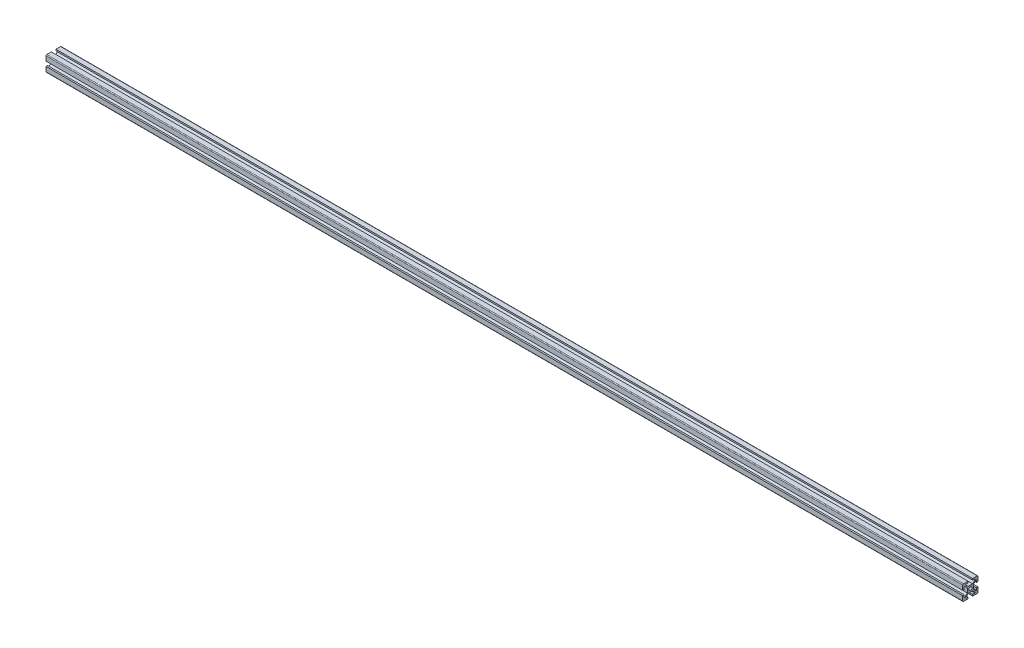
ISO-10303-21;
HEADER;
FILE_DESCRIPTION(('STEP AP214'),'2;1');
FILE_NAME('part.step','',(''),(''),'','','');
FILE_SCHEMA(('AUTOMOTIVE_DESIGN { 1 0 10303 214 1 1 1 1 }'));
ENDSEC;
DATA;
#1=APPLICATION_CONTEXT('core data for automotive mechanical design processes');
#2=APPLICATION_PROTOCOL_DEFINITION('international standard','automotive_design',2000,#1);
#3=PRODUCT_CONTEXT('',#1,'mechanical');
#4=PRODUCT('Part','Part','',(#3));
#5=PRODUCT_RELATED_PRODUCT_CATEGORY('part','',(#4));
#6=PRODUCT_DEFINITION_FORMATION('','',#4);
#7=PRODUCT_DEFINITION_CONTEXT('part definition',#1,'design');
#8=PRODUCT_DEFINITION('design','',#6,#7);
#9=PRODUCT_DEFINITION_SHAPE('','',#8);
#10=(LENGTH_UNIT() NAMED_UNIT(*) SI_UNIT(.MILLI.,.METRE.));
#11=(NAMED_UNIT(*) PLANE_ANGLE_UNIT() SI_UNIT($,.RADIAN.));
#12=(NAMED_UNIT(*) SI_UNIT($,.STERADIAN.) SOLID_ANGLE_UNIT());
#13=UNCERTAINTY_MEASURE_WITH_UNIT(LENGTH_MEASURE(1.E-05),#10,'distance_accuracy_value','');
#14=(GEOMETRIC_REPRESENTATION_CONTEXT(3) GLOBAL_UNCERTAINTY_ASSIGNED_CONTEXT((#13)) GLOBAL_UNIT_ASSIGNED_CONTEXT((#10,
#11,#12)) REPRESENTATION_CONTEXT('',''));
#15=CARTESIAN_POINT('',(0.,0.,0.));
#16=DIRECTION('',(0.,0.,1.));
#17=DIRECTION('',(1.,0.,0.));
#18=AXIS2_PLACEMENT_3D('',#15,#16,#17);
#19=CARTESIAN_POINT('',(1200.,9.,9.));
#20=DIRECTION('',(1.,0.,0.));
#21=DIRECTION('',(0.,0.,-1.));
#22=AXIS2_PLACEMENT_3D('',#19,#20,#21);
#23=PLANE('',#22);
#24=CARTESIAN_POINT('',(1200.,9.,9.));
#25=DIRECTION('',(1.,0.,0.));
#26=DIRECTION('',(0.,0.,-1.));
#27=AXIS2_PLACEMENT_3D('',#24,#25,#26);
#28=CIRCLE('',#27,1.);
#29=CARTESIAN_POINT('',(1200.,10.,9.));
#30=VERTEX_POINT('',#29);
#31=CARTESIAN_POINT('',(1200.,9.,10.));
#32=VERTEX_POINT('',#31);
#33=EDGE_CURVE('E472',#30,#32,#28,.T.);
#34=ORIENTED_EDGE('',*,*,#33,.T.);
#35=DIRECTION('',(0.,-1.,0.));
#36=VECTOR('',#35,1.);
#37=CARTESIAN_POINT('',(1200.,9.,10.));
#38=LINE('',#37,#36);
#39=CARTESIAN_POINT('',(1200.,3.,10.));
#40=VERTEX_POINT('',#39);
#41=EDGE_CURVE('E217',#32,#40,#38,.T.);
#42=ORIENTED_EDGE('',*,*,#41,.T.);
#43=DIRECTION('',(0.,0.,-1.));
#44=VECTOR('',#43,1.);
#45=CARTESIAN_POINT('',(1200.,3.,10.));
#46=LINE('',#45,#44);
#47=CARTESIAN_POINT('',(1200.,3.,8.));
#48=VERTEX_POINT('',#47);
#49=EDGE_CURVE('E607',#40,#48,#46,.T.);
#50=ORIENTED_EDGE('',*,*,#49,.T.);
#51=DIRECTION('',(0.,1.,0.));
#52=VECTOR('',#51,1.);
#53=CARTESIAN_POINT('',(1200.,3.,8.));
#54=LINE('',#53,#52);
#55=CARTESIAN_POINT('',(1200.,6.,8.));
#56=VERTEX_POINT('',#55);
#57=EDGE_CURVE('E623',#48,#56,#54,.T.);
#58=ORIENTED_EDGE('',*,*,#57,.T.);
#59=DIRECTION('',(0.,0.,-1.));
#60=VECTOR('',#59,1.);
#61=CARTESIAN_POINT('',(1200.,6.,8.));
#62=LINE('',#61,#60);
#63=CARTESIAN_POINT('',(1200.,6.,7.06066017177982));
#64=VERTEX_POINT('',#63);
#65=EDGE_CURVE('E625',#56,#64,#62,.T.);
#66=ORIENTED_EDGE('',*,*,#65,.T.);
#67=DIRECTION('',(0.,-0.707106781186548,-0.707106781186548));
#68=VECTOR('',#67,1.);
#69=CARTESIAN_POINT('',(1200.,6.,7.06066017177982));
#70=LINE('',#69,#68);
#71=CARTESIAN_POINT('',(1200.,2.93933982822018,4.));
#72=VERTEX_POINT('',#71);
#73=EDGE_CURVE('E621',#64,#72,#70,.T.);
#74=ORIENTED_EDGE('',*,*,#73,.T.);
#75=DIRECTION('',(0.,-1.,0.));
#76=VECTOR('',#75,1.);
#77=CARTESIAN_POINT('',(1200.,2.93933982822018,4.));
#78=LINE('',#77,#76);
#79=CARTESIAN_POINT('',(1200.,-2.93933982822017,4.));
#80=VERTEX_POINT('',#79);
#81=EDGE_CURVE('E627',#72,#80,#78,.T.);
#82=ORIENTED_EDGE('',*,*,#81,.T.);
#83=DIRECTION('',(0.,-0.707106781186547,0.707106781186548));
#84=VECTOR('',#83,1.);
#85=CARTESIAN_POINT('',(1200.,-2.93933982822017,4.));
#86=LINE('',#85,#84);
#87=CARTESIAN_POINT('',(1200.,-6.,7.06066017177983));
#88=VERTEX_POINT('',#87);
#89=EDGE_CURVE('E631',#80,#88,#86,.T.);
#90=ORIENTED_EDGE('',*,*,#89,.T.);
#91=DIRECTION('',(0.,0.,1.));
#92=VECTOR('',#91,1.);
#93=CARTESIAN_POINT('',(1200.,-6.,7.06066017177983));
#94=LINE('',#93,#92);
#95=CARTESIAN_POINT('',(1200.,-6.,7.99999999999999));
#96=VERTEX_POINT('',#95);
#97=EDGE_CURVE('E634',#88,#96,#94,.T.);
#98=ORIENTED_EDGE('',*,*,#97,.T.);
#99=DIRECTION('',(0.,1.,0.));
#100=VECTOR('',#99,1.);
#101=CARTESIAN_POINT('',(1200.,-6.,7.99999999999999));
#102=LINE('',#101,#100);
#103=CARTESIAN_POINT('',(1200.,-3.,7.99999999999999));
#104=VERTEX_POINT('',#103);
#105=EDGE_CURVE('E640',#96,#104,#102,.T.);
#106=ORIENTED_EDGE('',*,*,#105,.T.);
#107=DIRECTION('',(0.,0.,1.));
#108=VECTOR('',#107,1.);
#109=CARTESIAN_POINT('',(1200.,-3.,7.99999999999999));
#110=LINE('',#109,#108);
#111=CARTESIAN_POINT('',(1200.,-3.,10.));
#112=VERTEX_POINT('',#111);
#113=EDGE_CURVE('E639',#104,#112,#110,.T.);
#114=ORIENTED_EDGE('',*,*,#113,.T.);
#115=DIRECTION('',(0.,-1.,0.));
#116=VECTOR('',#115,1.);
#117=CARTESIAN_POINT('',(1200.,-3.,10.));
#118=LINE('',#117,#116);
#119=CARTESIAN_POINT('',(1200.,-9.,10.));
#120=VERTEX_POINT('',#119);
#121=EDGE_CURVE('E641',#112,#120,#118,.T.);
#122=ORIENTED_EDGE('',*,*,#121,.T.);
#123=CARTESIAN_POINT('',(1200.,-9.,9.));
#124=DIRECTION('',(1.,0.,0.));
#125=DIRECTION('',(0.,0.,-1.));
#126=AXIS2_PLACEMENT_3D('',#123,#124,#125);
#127=CIRCLE('',#126,1.);
#128=CARTESIAN_POINT('',(1200.,-10.,9.));
#129=VERTEX_POINT('',#128);
#130=EDGE_CURVE('E643',#120,#129,#127,.T.);
#131=ORIENTED_EDGE('',*,*,#130,.T.);
#132=DIRECTION('',(0.,0.,-1.));
#133=VECTOR('',#132,1.);
#134=CARTESIAN_POINT('',(1200.,-10.,9.));
#135=LINE('',#134,#133);
#136=CARTESIAN_POINT('',(1200.,-10.,3.));
#137=VERTEX_POINT('',#136);
#138=EDGE_CURVE('E644',#129,#137,#135,.T.);
#139=ORIENTED_EDGE('',*,*,#138,.T.);
#140=DIRECTION('',(0.,1.,0.));
#141=VECTOR('',#140,1.);
#142=CARTESIAN_POINT('',(1200.,-10.,3.));
#143=LINE('',#142,#141);
#144=CARTESIAN_POINT('',(1200.,-8.,3.));
#145=VERTEX_POINT('',#144);
#146=EDGE_CURVE('E650',#137,#145,#143,.T.);
#147=ORIENTED_EDGE('',*,*,#146,.T.);
#148=DIRECTION('',(0.,0.,1.));
#149=VECTOR('',#148,1.);
#150=CARTESIAN_POINT('',(1200.,-8.,3.));
#151=LINE('',#150,#149);
#152=CARTESIAN_POINT('',(1200.,-8.,6.));
#153=VERTEX_POINT('',#152);
#154=EDGE_CURVE('E647',#145,#153,#151,.T.);
#155=ORIENTED_EDGE('',*,*,#154,.T.);
#156=DIRECTION('',(0.,1.,0.));
#157=VECTOR('',#156,1.);
#158=CARTESIAN_POINT('',(1200.,-8.,6.));
#159=LINE('',#158,#157);
#160=CARTESIAN_POINT('',(1200.,-7.06066017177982,6.));
#161=VERTEX_POINT('',#160);
#162=EDGE_CURVE('E651',#153,#161,#159,.T.);
#163=ORIENTED_EDGE('',*,*,#162,.T.);
#164=DIRECTION('',(0.,0.707106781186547,-0.707106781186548));
#165=VECTOR('',#164,1.);
#166=CARTESIAN_POINT('',(1200.,-7.06066017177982,6.));
#167=LINE('',#166,#165);
#168=CARTESIAN_POINT('',(1200.,-4.,2.93933982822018));
#169=VERTEX_POINT('',#168);
#170=EDGE_CURVE('E652',#161,#169,#167,.T.);
#171=ORIENTED_EDGE('',*,*,#170,.T.);
#172=DIRECTION('',(0.,0.,-1.));
#173=VECTOR('',#172,1.);
#174=CARTESIAN_POINT('',(1200.,-4.,2.93933982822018));
#175=LINE('',#174,#173);
#176=CARTESIAN_POINT('',(1200.,-4.,-2.93933982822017));
#177=VERTEX_POINT('',#176);
#178=EDGE_CURVE('E654',#169,#177,#175,.T.);
#179=ORIENTED_EDGE('',*,*,#178,.T.);
#180=DIRECTION('',(0.,-0.707106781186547,-0.707106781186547));
#181=VECTOR('',#180,1.);
#182=CARTESIAN_POINT('',(1200.,-4.,-2.93933982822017));
#183=LINE('',#182,#181);
#184=CARTESIAN_POINT('',(1200.,-7.06066017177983,-6.));
#185=VERTEX_POINT('',#184);
#186=EDGE_CURVE('E660',#177,#185,#183,.T.);
#187=ORIENTED_EDGE('',*,*,#186,.T.);
#188=DIRECTION('',(0.,-1.,0.));
#189=VECTOR('',#188,1.);
#190=CARTESIAN_POINT('',(1200.,-7.06066017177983,-6.));
#191=LINE('',#190,#189);
#192=CARTESIAN_POINT('',(1200.,-7.99999999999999,-6.));
#193=VERTEX_POINT('',#192);
#194=EDGE_CURVE('E656',#185,#193,#191,.T.);
#195=ORIENTED_EDGE('',*,*,#194,.T.);
#196=DIRECTION('',(0.,0.,1.));
#197=VECTOR('',#196,1.);
#198=CARTESIAN_POINT('',(1200.,-7.99999999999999,-6.));
#199=LINE('',#198,#197);
#200=CARTESIAN_POINT('',(1200.,-7.99999999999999,-3.));
#201=VERTEX_POINT('',#200);
#202=EDGE_CURVE('E662',#193,#201,#199,.T.);
#203=ORIENTED_EDGE('',*,*,#202,.T.);
#204=DIRECTION('',(0.,-1.,0.));
#205=VECTOR('',#204,1.);
#206=CARTESIAN_POINT('',(1200.,-7.99999999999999,-3.));
#207=LINE('',#206,#205);
#208=CARTESIAN_POINT('',(1200.,-10.,-3.));
#209=VERTEX_POINT('',#208);
#210=EDGE_CURVE('E663',#201,#209,#207,.T.);
#211=ORIENTED_EDGE('',*,*,#210,.T.);
#212=DIRECTION('',(0.,0.,-1.));
#213=VECTOR('',#212,1.);
#214=CARTESIAN_POINT('',(1200.,-10.,-3.));
#215=LINE('',#214,#213);
#216=CARTESIAN_POINT('',(1200.,-10.,-9.00000000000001));
#217=VERTEX_POINT('',#216);
#218=EDGE_CURVE('E661',#209,#217,#215,.T.);
#219=ORIENTED_EDGE('',*,*,#218,.T.);
#220=CARTESIAN_POINT('',(1200.,-9.,-9.00000000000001));
#221=DIRECTION('',(1.,0.,0.));
#222=DIRECTION('',(0.,0.,-1.));
#223=AXIS2_PLACEMENT_3D('',#220,#221,#222);
#224=CIRCLE('',#223,0.999999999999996);
#225=CARTESIAN_POINT('',(1200.,-9.,-10.));
#226=VERTEX_POINT('',#225);
#227=EDGE_CURVE('E670',#217,#226,#224,.T.);
#228=ORIENTED_EDGE('',*,*,#227,.T.);
#229=DIRECTION('',(0.,1.,0.));
#230=VECTOR('',#229,1.);
#231=CARTESIAN_POINT('',(1200.,-9.,-10.));
#232=LINE('',#231,#230);
#233=CARTESIAN_POINT('',(1200.,-3.,-10.));
#234=VERTEX_POINT('',#233);
#235=EDGE_CURVE('E667',#226,#234,#232,.T.);
#236=ORIENTED_EDGE('',*,*,#235,.T.);
#237=DIRECTION('',(0.,0.,1.));
#238=VECTOR('',#237,1.);
#239=CARTESIAN_POINT('',(1200.,-3.,-10.));
#240=LINE('',#239,#238);
#241=CARTESIAN_POINT('',(1200.,-3.,-8.00000000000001));
#242=VERTEX_POINT('',#241);
#243=EDGE_CURVE('E672',#234,#242,#240,.T.);
#244=ORIENTED_EDGE('',*,*,#243,.T.);
#245=DIRECTION('',(0.,-1.,0.));
#246=VECTOR('',#245,1.);
#247=CARTESIAN_POINT('',(1200.,-3.,-8.00000000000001));
#248=LINE('',#247,#246);
#249=CARTESIAN_POINT('',(1200.,-6.,-8.00000000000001));
#250=VERTEX_POINT('',#249);
#251=EDGE_CURVE('E674',#242,#250,#248,.T.);
#252=ORIENTED_EDGE('',*,*,#251,.T.);
#253=DIRECTION('',(0.,0.,1.));
#254=VECTOR('',#253,1.);
#255=CARTESIAN_POINT('',(1200.,-6.,-8.00000000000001));
#256=LINE('',#255,#254);
#257=CARTESIAN_POINT('',(1200.,-6.,-7.06066017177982));
#258=VERTEX_POINT('',#257);
#259=EDGE_CURVE('E673',#250,#258,#256,.T.);
#260=ORIENTED_EDGE('',*,*,#259,.T.);
#261=DIRECTION('',(0.,0.707106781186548,0.707106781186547));
#262=VECTOR('',#261,1.);
#263=CARTESIAN_POINT('',(1200.,-6.,-7.06066017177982));
#264=LINE('',#263,#262);
#265=CARTESIAN_POINT('',(1200.,-2.93933982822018,-4.));
#266=VERTEX_POINT('',#265);
#267=EDGE_CURVE('E677',#258,#266,#264,.T.);
#268=ORIENTED_EDGE('',*,*,#267,.T.);
#269=DIRECTION('',(0.,1.,0.));
#270=VECTOR('',#269,1.);
#271=CARTESIAN_POINT('',(1200.,-2.93933982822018,-4.));
#272=LINE('',#271,#270);
#273=CARTESIAN_POINT('',(1200.,2.93933982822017,-4.));
#274=VERTEX_POINT('',#273);
#275=EDGE_CURVE('E678',#266,#274,#272,.T.);
#276=ORIENTED_EDGE('',*,*,#275,.T.);
#277=DIRECTION('',(0.,0.707106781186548,-0.707106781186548));
#278=VECTOR('',#277,1.);
#279=CARTESIAN_POINT('',(1200.,2.93933982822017,-4.));
#280=LINE('',#279,#278);
#281=CARTESIAN_POINT('',(1200.,6.,-7.06066017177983));
#282=VERTEX_POINT('',#281);
#283=EDGE_CURVE('E682',#274,#282,#280,.T.);
#284=ORIENTED_EDGE('',*,*,#283,.T.);
#285=DIRECTION('',(0.,0.,-1.));
#286=VECTOR('',#285,1.);
#287=CARTESIAN_POINT('',(1200.,6.,-7.06066017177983));
#288=LINE('',#287,#286);
#289=CARTESIAN_POINT('',(1200.,6.,-7.99999999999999));
#290=VERTEX_POINT('',#289);
#291=EDGE_CURVE('E681',#282,#290,#288,.T.);
#292=ORIENTED_EDGE('',*,*,#291,.T.);
#293=DIRECTION('',(0.,-1.,0.));
#294=VECTOR('',#293,1.);
#295=CARTESIAN_POINT('',(1200.,6.,-7.99999999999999));
#296=LINE('',#295,#294);
#297=CARTESIAN_POINT('',(1200.,3.,-7.99999999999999));
#298=VERTEX_POINT('',#297);
#299=EDGE_CURVE('E683',#290,#298,#296,.T.);
#300=ORIENTED_EDGE('',*,*,#299,.T.);
#301=DIRECTION('',(0.,0.,-1.));
#302=VECTOR('',#301,1.);
#303=CARTESIAN_POINT('',(1200.,3.,-7.99999999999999));
#304=LINE('',#303,#302);
#305=CARTESIAN_POINT('',(1200.,3.,-10.));
#306=VERTEX_POINT('',#305);
#307=EDGE_CURVE('E690',#298,#306,#304,.T.);
#308=ORIENTED_EDGE('',*,*,#307,.T.);
#309=DIRECTION('',(0.,1.,0.));
#310=VECTOR('',#309,1.);
#311=CARTESIAN_POINT('',(1200.,3.,-10.));
#312=LINE('',#311,#310);
#313=CARTESIAN_POINT('',(1200.,9.,-10.));
#314=VERTEX_POINT('',#313);
#315=EDGE_CURVE('E689',#306,#314,#312,.T.);
#316=ORIENTED_EDGE('',*,*,#315,.T.);
#317=CARTESIAN_POINT('',(1200.,9.,-9.00000000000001));
#318=DIRECTION('',(1.,0.,0.));
#319=DIRECTION('',(0.,0.,-1.));
#320=AXIS2_PLACEMENT_3D('',#317,#318,#319);
#321=CIRCLE('',#320,1.);
#322=CARTESIAN_POINT('',(1200.,10.,-9.00000000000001));
#323=VERTEX_POINT('',#322);
#324=EDGE_CURVE('E693',#314,#323,#321,.T.);
#325=ORIENTED_EDGE('',*,*,#324,.T.);
#326=DIRECTION('',(0.,0.,1.));
#327=VECTOR('',#326,1.);
#328=CARTESIAN_POINT('',(1200.,10.,-9.00000000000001));
#329=LINE('',#328,#327);
#330=CARTESIAN_POINT('',(1200.,10.,-3.));
#331=VERTEX_POINT('',#330);
#332=EDGE_CURVE('E691',#323,#331,#329,.T.);
#333=ORIENTED_EDGE('',*,*,#332,.T.);
#334=DIRECTION('',(0.,-1.,0.));
#335=VECTOR('',#334,1.);
#336=CARTESIAN_POINT('',(1200.,10.,-3.));
#337=LINE('',#336,#335);
#338=CARTESIAN_POINT('',(1200.,8.,-3.));
#339=VERTEX_POINT('',#338);
#340=EDGE_CURVE('E694',#331,#339,#337,.T.);
#341=ORIENTED_EDGE('',*,*,#340,.T.);
#342=DIRECTION('',(0.,0.,-1.));
#343=VECTOR('',#342,1.);
#344=CARTESIAN_POINT('',(1200.,8.,-3.));
#345=LINE('',#344,#343);
#346=CARTESIAN_POINT('',(1200.,8.,-6.));
#347=VERTEX_POINT('',#346);
#348=EDGE_CURVE('E700',#339,#347,#345,.T.);
#349=ORIENTED_EDGE('',*,*,#348,.T.);
#350=DIRECTION('',(0.,-1.,0.));
#351=VECTOR('',#350,1.);
#352=CARTESIAN_POINT('',(1200.,8.,-6.));
#353=LINE('',#352,#351);
#354=CARTESIAN_POINT('',(1200.,7.06066017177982,-6.));
#355=VERTEX_POINT('',#354);
#356=EDGE_CURVE('E696',#347,#355,#353,.T.);
#357=ORIENTED_EDGE('',*,*,#356,.T.);
#358=DIRECTION('',(0.,-0.707106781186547,0.707106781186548));
#359=VECTOR('',#358,1.);
#360=CARTESIAN_POINT('',(1200.,7.06066017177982,-6.));
#361=LINE('',#360,#359);
#362=CARTESIAN_POINT('',(1200.,4.,-2.93933982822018));
#363=VERTEX_POINT('',#362);
#364=EDGE_CURVE('E701',#355,#363,#361,.T.);
#365=ORIENTED_EDGE('',*,*,#364,.T.);
#366=DIRECTION('',(0.,0.,1.));
#367=VECTOR('',#366,1.);
#368=CARTESIAN_POINT('',(1200.,4.,-2.93933982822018));
#369=LINE('',#368,#367);
#370=CARTESIAN_POINT('',(1200.,4.,2.93933982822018));
#371=VERTEX_POINT('',#370);
#372=EDGE_CURVE('E704',#363,#371,#369,.T.);
#373=ORIENTED_EDGE('',*,*,#372,.T.);
#374=DIRECTION('',(0.,0.707106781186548,0.707106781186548));
#375=VECTOR('',#374,1.);
#376=CARTESIAN_POINT('',(1200.,4.,2.93933982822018));
#377=LINE('',#376,#375);
#378=CARTESIAN_POINT('',(1200.,7.06066017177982,6.));
#379=VERTEX_POINT('',#378);
#380=EDGE_CURVE('E705',#371,#379,#377,.T.);
#381=ORIENTED_EDGE('',*,*,#380,.T.);
#382=DIRECTION('',(0.,1.,0.));
#383=VECTOR('',#382,1.);
#384=CARTESIAN_POINT('',(1200.,7.06066017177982,6.));
#385=LINE('',#384,#383);
#386=CARTESIAN_POINT('',(1200.,7.99999999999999,6.));
#387=VERTEX_POINT('',#386);
#388=EDGE_CURVE('E359',#379,#387,#385,.T.);
#389=ORIENTED_EDGE('',*,*,#388,.T.);
#390=DIRECTION('',(0.,0.,-1.));
#391=VECTOR('',#390,1.);
#392=CARTESIAN_POINT('',(1200.,7.99999999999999,6.));
#393=LINE('',#392,#391);
#394=CARTESIAN_POINT('',(1200.,7.99999999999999,3.));
#395=VERTEX_POINT('',#394);
#396=EDGE_CURVE('E355',#387,#395,#393,.T.);
#397=ORIENTED_EDGE('',*,*,#396,.T.);
#398=DIRECTION('',(0.,1.,0.));
#399=VECTOR('',#398,1.);
#400=CARTESIAN_POINT('',(1200.,7.99999999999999,3.));
#401=LINE('',#400,#399);
#402=CARTESIAN_POINT('',(1200.,10.,3.));
#403=VERTEX_POINT('',#402);
#404=EDGE_CURVE('E357',#395,#403,#401,.T.);
#405=ORIENTED_EDGE('',*,*,#404,.T.);
#406=DIRECTION('',(0.,0.,1.));
#407=VECTOR('',#406,1.);
#408=CARTESIAN_POINT('',(1200.,10.,3.));
#409=LINE('',#408,#407);
#410=EDGE_CURVE('E57',#403,#30,#409,.T.);
#411=ORIENTED_EDGE('',*,*,#410,.T.);
#412=EDGE_LOOP('',(#34,#42,#50,#58,#66,#74,#82,#90,#98,#106,#114,#122,#131,#139,#147,#155,#163,
#171,#179,#187,#195,#203,#211,#219,#228,#236,#244,#252,#260,#268,#276,#284,#292,#300,#308,#316,
#325,#333,#341,#349,#357,#365,#373,#381,#389,#397,#405,#411));
#413=FACE_BOUND('',#412,.T.);
#414=CARTESIAN_POINT('',(1200.,0.,0.));
#415=DIRECTION('',(1.,0.,0.));
#416=DIRECTION('',(0.,0.,-1.));
#417=AXIS2_PLACEMENT_3D('',#414,#415,#416);
#418=CIRCLE('',#417,2.1);
#419=CARTESIAN_POINT('',(1200.,0.,-2.1));
#420=VERTEX_POINT('',#419);
#421=EDGE_CURVE('E380',#420,#420,#418,.T.);
#422=ORIENTED_EDGE('',*,*,#421,.F.);
#423=EDGE_LOOP('',(#422));
#424=FACE_BOUND('',#423,.T.);
#425=ADVANCED_FACE('F39',(#413,#424),#23,.T.);
#426=CARTESIAN_POINT('',(0.,9.,9.));
#427=DIRECTION('',(1.,0.,0.));
#428=DIRECTION('',(0.,0.,-1.));
#429=AXIS2_PLACEMENT_3D('',#426,#427,#428);
#430=PLANE('',#429);
#431=CARTESIAN_POINT('',(0.,9.,9.));
#432=DIRECTION('',(1.,0.,0.));
#433=DIRECTION('',(0.,0.,-1.));
#434=AXIS2_PLACEMENT_3D('',#431,#432,#433);
#435=CIRCLE('',#434,1.);
#436=CARTESIAN_POINT('',(0.,10.,9.));
#437=VERTEX_POINT('',#436);
#438=CARTESIAN_POINT('',(0.,9.,10.));
#439=VERTEX_POINT('',#438);
#440=EDGE_CURVE('E376',#437,#439,#435,.T.);
#441=ORIENTED_EDGE('',*,*,#440,.F.);
#442=DIRECTION('',(0.,0.,1.));
#443=VECTOR('',#442,1.);
#444=CARTESIAN_POINT('',(0.,10.,3.));
#445=LINE('',#444,#443);
#446=CARTESIAN_POINT('',(0.,10.,3.));
#447=VERTEX_POINT('',#446);
#448=EDGE_CURVE('E212',#447,#437,#445,.T.);
#449=ORIENTED_EDGE('',*,*,#448,.F.);
#450=DIRECTION('',(0.,1.,0.));
#451=VECTOR('',#450,1.);
#452=CARTESIAN_POINT('',(0.,7.99999999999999,3.));
#453=LINE('',#452,#451);
#454=CARTESIAN_POINT('',(0.,7.99999999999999,3.));
#455=VERTEX_POINT('',#454);
#456=EDGE_CURVE('E204',#455,#447,#453,.T.);
#457=ORIENTED_EDGE('',*,*,#456,.F.);
#458=DIRECTION('',(0.,0.,-1.));
#459=VECTOR('',#458,1.);
#460=CARTESIAN_POINT('',(0.,7.99999999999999,6.));
#461=LINE('',#460,#459);
#462=CARTESIAN_POINT('',(0.,7.99999999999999,6.));
#463=VERTEX_POINT('',#462);
#464=EDGE_CURVE('E368',#463,#455,#461,.T.);
#465=ORIENTED_EDGE('',*,*,#464,.F.);
#466=DIRECTION('',(0.,1.,0.));
#467=VECTOR('',#466,1.);
#468=CARTESIAN_POINT('',(0.,7.06066017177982,6.));
#469=LINE('',#468,#467);
#470=CARTESIAN_POINT('',(0.,7.06066017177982,6.));
#471=VERTEX_POINT('',#470);
#472=EDGE_CURVE('E468',#471,#463,#469,.T.);
#473=ORIENTED_EDGE('',*,*,#472,.F.);
#474=DIRECTION('',(0.,0.707106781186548,0.707106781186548));
#475=VECTOR('',#474,1.);
#476=CARTESIAN_POINT('',(0.,4.,2.93933982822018));
#477=LINE('',#476,#475);
#478=CARTESIAN_POINT('',(0.,4.,2.93933982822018));
#479=VERTEX_POINT('',#478);
#480=EDGE_CURVE('E464',#479,#471,#477,.T.);
#481=ORIENTED_EDGE('',*,*,#480,.F.);
#482=DIRECTION('',(0.,0.,1.));
#483=VECTOR('',#482,1.);
#484=CARTESIAN_POINT('',(0.,4.,-2.93933982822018));
#485=LINE('',#484,#483);
#486=CARTESIAN_POINT('',(0.,4.,-2.93933982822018));
#487=VERTEX_POINT('',#486);
#488=EDGE_CURVE('E465',#487,#479,#485,.T.);
#489=ORIENTED_EDGE('',*,*,#488,.F.);
#490=DIRECTION('',(0.,-0.707106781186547,0.707106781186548));
#491=VECTOR('',#490,1.);
#492=CARTESIAN_POINT('',(0.,7.06066017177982,-6.));
#493=LINE('',#492,#491);
#494=CARTESIAN_POINT('',(0.,7.06066017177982,-6.));
#495=VERTEX_POINT('',#494);
#496=EDGE_CURVE('E458',#495,#487,#493,.T.);
#497=ORIENTED_EDGE('',*,*,#496,.F.);
#498=DIRECTION('',(0.,-1.,0.));
#499=VECTOR('',#498,1.);
#500=CARTESIAN_POINT('',(0.,8.,-6.));
#501=LINE('',#500,#499);
#502=CARTESIAN_POINT('',(0.,8.,-6.));
#503=VERTEX_POINT('',#502);
#504=EDGE_CURVE('E456',#503,#495,#501,.T.);
#505=ORIENTED_EDGE('',*,*,#504,.F.);
#506=DIRECTION('',(0.,0.,-1.));
#507=VECTOR('',#506,1.);
#508=CARTESIAN_POINT('',(0.,8.,-3.));
#509=LINE('',#508,#507);
#510=CARTESIAN_POINT('',(0.,8.,-3.));
#511=VERTEX_POINT('',#510);
#512=EDGE_CURVE('E457',#511,#503,#509,.T.);
#513=ORIENTED_EDGE('',*,*,#512,.F.);
#514=DIRECTION('',(0.,-1.,0.));
#515=VECTOR('',#514,1.);
#516=CARTESIAN_POINT('',(0.,10.,-3.));
#517=LINE('',#516,#515);
#518=CARTESIAN_POINT('',(0.,10.,-3.));
#519=VERTEX_POINT('',#518);
#520=EDGE_CURVE('E453',#519,#511,#517,.T.);
#521=ORIENTED_EDGE('',*,*,#520,.F.);
#522=DIRECTION('',(0.,0.,1.));
#523=VECTOR('',#522,1.);
#524=CARTESIAN_POINT('',(0.,10.,-9.00000000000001));
#525=LINE('',#524,#523);
#526=CARTESIAN_POINT('',(0.,10.,-9.00000000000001));
#527=VERTEX_POINT('',#526);
#528=EDGE_CURVE('E452',#527,#519,#525,.T.);
#529=ORIENTED_EDGE('',*,*,#528,.F.);
#530=CARTESIAN_POINT('',(0.,9.,-9.00000000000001));
#531=DIRECTION('',(1.,0.,0.));
#532=DIRECTION('',(0.,0.,-1.));
#533=AXIS2_PLACEMENT_3D('',#530,#531,#532);
#534=CIRCLE('',#533,1.);
#535=CARTESIAN_POINT('',(0.,9.,-10.));
#536=VERTEX_POINT('',#535);
#537=EDGE_CURVE('E448',#536,#527,#534,.T.);
#538=ORIENTED_EDGE('',*,*,#537,.F.);
#539=DIRECTION('',(0.,1.,0.));
#540=VECTOR('',#539,1.);
#541=CARTESIAN_POINT('',(0.,3.,-10.));
#542=LINE('',#541,#540);
#543=CARTESIAN_POINT('',(0.,3.,-10.));
#544=VERTEX_POINT('',#543);
#545=EDGE_CURVE('E449',#544,#536,#542,.T.);
#546=ORIENTED_EDGE('',*,*,#545,.F.);
#547=DIRECTION('',(0.,0.,-1.));
#548=VECTOR('',#547,1.);
#549=CARTESIAN_POINT('',(0.,3.,-7.99999999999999));
#550=LINE('',#549,#548);
#551=CARTESIAN_POINT('',(0.,3.,-7.99999999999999));
#552=VERTEX_POINT('',#551);
#553=EDGE_CURVE('E447',#552,#544,#550,.T.);
#554=ORIENTED_EDGE('',*,*,#553,.F.);
#555=DIRECTION('',(0.,-1.,0.));
#556=VECTOR('',#555,1.);
#557=CARTESIAN_POINT('',(0.,6.,-7.99999999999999));
#558=LINE('',#557,#556);
#559=CARTESIAN_POINT('',(0.,6.,-7.99999999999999));
#560=VERTEX_POINT('',#559);
#561=EDGE_CURVE('E442',#560,#552,#558,.T.);
#562=ORIENTED_EDGE('',*,*,#561,.F.);
#563=DIRECTION('',(0.,0.,-1.));
#564=VECTOR('',#563,1.);
#565=CARTESIAN_POINT('',(0.,6.,-7.06066017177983));
#566=LINE('',#565,#564);
#567=CARTESIAN_POINT('',(0.,6.,-7.06066017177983));
#568=VERTEX_POINT('',#567);
#569=EDGE_CURVE('E445',#568,#560,#566,.T.);
#570=ORIENTED_EDGE('',*,*,#569,.F.);
#571=DIRECTION('',(0.,0.707106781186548,-0.707106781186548));
#572=VECTOR('',#571,1.);
#573=CARTESIAN_POINT('',(0.,2.93933982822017,-4.));
#574=LINE('',#573,#572);
#575=CARTESIAN_POINT('',(0.,2.93933982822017,-4.));
#576=VERTEX_POINT('',#575);
#577=EDGE_CURVE('E436',#576,#568,#574,.T.);
#578=ORIENTED_EDGE('',*,*,#577,.F.);
#579=DIRECTION('',(0.,1.,0.));
#580=VECTOR('',#579,1.);
#581=CARTESIAN_POINT('',(0.,-2.93933982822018,-4.));
#582=LINE('',#581,#580);
#583=CARTESIAN_POINT('',(0.,-2.93933982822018,-4.));
#584=VERTEX_POINT('',#583);
#585=EDGE_CURVE('E438',#584,#576,#582,.T.);
#586=ORIENTED_EDGE('',*,*,#585,.F.);
#587=DIRECTION('',(0.,0.707106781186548,0.707106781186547));
#588=VECTOR('',#587,1.);
#589=CARTESIAN_POINT('',(0.,-6.,-7.06066017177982));
#590=LINE('',#589,#588);
#591=CARTESIAN_POINT('',(0.,-6.,-7.06066017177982));
#592=VERTEX_POINT('',#591);
#593=EDGE_CURVE('E437',#592,#584,#590,.T.);
#594=ORIENTED_EDGE('',*,*,#593,.F.);
#595=DIRECTION('',(0.,0.,1.));
#596=VECTOR('',#595,1.);
#597=CARTESIAN_POINT('',(0.,-6.,-8.00000000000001));
#598=LINE('',#597,#596);
#599=CARTESIAN_POINT('',(0.,-6.,-8.00000000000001));
#600=VERTEX_POINT('',#599);
#601=EDGE_CURVE('E431',#600,#592,#598,.T.);
#602=ORIENTED_EDGE('',*,*,#601,.F.);
#603=DIRECTION('',(0.,-1.,0.));
#604=VECTOR('',#603,1.);
#605=CARTESIAN_POINT('',(0.,-3.,-8.00000000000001));
#606=LINE('',#605,#604);
#607=CARTESIAN_POINT('',(0.,-3.,-8.00000000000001));
#608=VERTEX_POINT('',#607);
#609=EDGE_CURVE('E435',#608,#600,#606,.T.);
#610=ORIENTED_EDGE('',*,*,#609,.F.);
#611=DIRECTION('',(0.,0.,1.));
#612=VECTOR('',#611,1.);
#613=CARTESIAN_POINT('',(0.,-3.,-10.));
#614=LINE('',#613,#612);
#615=CARTESIAN_POINT('',(0.,-3.,-10.));
#616=VERTEX_POINT('',#615);
#617=EDGE_CURVE('E429',#616,#608,#614,.T.);
#618=ORIENTED_EDGE('',*,*,#617,.F.);
#619=DIRECTION('',(0.,1.,0.));
#620=VECTOR('',#619,1.);
#621=CARTESIAN_POINT('',(0.,-9.,-10.));
#622=LINE('',#621,#620);
#623=CARTESIAN_POINT('',(0.,-9.,-10.));
#624=VERTEX_POINT('',#623);
#625=EDGE_CURVE('E427',#624,#616,#622,.T.);
#626=ORIENTED_EDGE('',*,*,#625,.F.);
#627=CARTESIAN_POINT('',(0.,-9.,-9.00000000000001));
#628=DIRECTION('',(1.,0.,0.));
#629=DIRECTION('',(0.,0.,-1.));
#630=AXIS2_PLACEMENT_3D('',#627,#628,#629);
#631=CIRCLE('',#630,0.999999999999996);
#632=CARTESIAN_POINT('',(0.,-10.,-9.00000000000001));
#633=VERTEX_POINT('',#632);
#634=EDGE_CURVE('E426',#633,#624,#631,.T.);
#635=ORIENTED_EDGE('',*,*,#634,.F.);
#636=DIRECTION('',(0.,0.,-1.));
#637=VECTOR('',#636,1.);
#638=CARTESIAN_POINT('',(0.,-10.,-3.));
#639=LINE('',#638,#637);
#640=CARTESIAN_POINT('',(0.,-10.,-3.));
#641=VERTEX_POINT('',#640);
#642=EDGE_CURVE('E422',#641,#633,#639,.T.);
#643=ORIENTED_EDGE('',*,*,#642,.F.);
#644=DIRECTION('',(0.,-1.,0.));
#645=VECTOR('',#644,1.);
#646=CARTESIAN_POINT('',(0.,-7.99999999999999,-3.));
#647=LINE('',#646,#645);
#648=CARTESIAN_POINT('',(0.,-7.99999999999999,-3.));
#649=VERTEX_POINT('',#648);
#650=EDGE_CURVE('E425',#649,#641,#647,.T.);
#651=ORIENTED_EDGE('',*,*,#650,.F.);
#652=DIRECTION('',(0.,0.,1.));
#653=VECTOR('',#652,1.);
#654=CARTESIAN_POINT('',(0.,-7.99999999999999,-6.));
#655=LINE('',#654,#653);
#656=CARTESIAN_POINT('',(0.,-7.99999999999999,-6.));
#657=VERTEX_POINT('',#656);
#658=EDGE_CURVE('E419',#657,#649,#655,.T.);
#659=ORIENTED_EDGE('',*,*,#658,.F.);
#660=DIRECTION('',(0.,-1.,0.));
#661=VECTOR('',#660,1.);
#662=CARTESIAN_POINT('',(0.,-7.06066017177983,-6.));
#663=LINE('',#662,#661);
#664=CARTESIAN_POINT('',(0.,-7.06066017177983,-6.));
#665=VERTEX_POINT('',#664);
#666=EDGE_CURVE('E418',#665,#657,#663,.T.);
#667=ORIENTED_EDGE('',*,*,#666,.F.);
#668=DIRECTION('',(0.,-0.707106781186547,-0.707106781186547));
#669=VECTOR('',#668,1.);
#670=CARTESIAN_POINT('',(0.,-4.,-2.93933982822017));
#671=LINE('',#670,#669);
#672=CARTESIAN_POINT('',(0.,-4.,-2.93933982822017));
#673=VERTEX_POINT('',#672);
#674=EDGE_CURVE('E416',#673,#665,#671,.T.);
#675=ORIENTED_EDGE('',*,*,#674,.F.);
#676=DIRECTION('',(0.,0.,-1.));
#677=VECTOR('',#676,1.);
#678=CARTESIAN_POINT('',(0.,-4.,2.93933982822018));
#679=LINE('',#678,#677);
#680=CARTESIAN_POINT('',(0.,-4.,2.93933982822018));
#681=VERTEX_POINT('',#680);
#682=EDGE_CURVE('E414',#681,#673,#679,.T.);
#683=ORIENTED_EDGE('',*,*,#682,.F.);
#684=DIRECTION('',(0.,0.707106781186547,-0.707106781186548));
#685=VECTOR('',#684,1.);
#686=CARTESIAN_POINT('',(0.,-7.06066017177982,6.));
#687=LINE('',#686,#685);
#688=CARTESIAN_POINT('',(0.,-7.06066017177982,6.));
#689=VERTEX_POINT('',#688);
#690=EDGE_CURVE('E415',#689,#681,#687,.T.);
#691=ORIENTED_EDGE('',*,*,#690,.F.);
#692=DIRECTION('',(0.,1.,0.));
#693=VECTOR('',#692,1.);
#694=CARTESIAN_POINT('',(0.,-8.,6.));
#695=LINE('',#694,#693);
#696=CARTESIAN_POINT('',(0.,-8.,6.));
#697=VERTEX_POINT('',#696);
#698=EDGE_CURVE('E409',#697,#689,#695,.T.);
#699=ORIENTED_EDGE('',*,*,#698,.F.);
#700=DIRECTION('',(0.,0.,1.));
#701=VECTOR('',#700,1.);
#702=CARTESIAN_POINT('',(0.,-8.,3.));
#703=LINE('',#702,#701);
#704=CARTESIAN_POINT('',(0.,-8.,3.));
#705=VERTEX_POINT('',#704);
#706=EDGE_CURVE('E406',#705,#697,#703,.T.);
#707=ORIENTED_EDGE('',*,*,#706,.F.);
#708=DIRECTION('',(0.,1.,0.));
#709=VECTOR('',#708,1.);
#710=CARTESIAN_POINT('',(0.,-10.,3.));
#711=LINE('',#710,#709);
#712=CARTESIAN_POINT('',(0.,-10.,3.));
#713=VERTEX_POINT('',#712);
#714=EDGE_CURVE('E408',#713,#705,#711,.T.);
#715=ORIENTED_EDGE('',*,*,#714,.F.);
#716=DIRECTION('',(0.,0.,-1.));
#717=VECTOR('',#716,1.);
#718=CARTESIAN_POINT('',(0.,-10.,9.));
#719=LINE('',#718,#717);
#720=CARTESIAN_POINT('',(0.,-10.,9.));
#721=VERTEX_POINT('',#720);
#722=EDGE_CURVE('E403',#721,#713,#719,.T.);
#723=ORIENTED_EDGE('',*,*,#722,.F.);
#724=CARTESIAN_POINT('',(0.,-9.,9.));
#725=DIRECTION('',(1.,0.,0.));
#726=DIRECTION('',(0.,0.,-1.));
#727=AXIS2_PLACEMENT_3D('',#724,#725,#726);
#728=CIRCLE('',#727,1.);
#729=CARTESIAN_POINT('',(0.,-9.,10.));
#730=VERTEX_POINT('',#729);
#731=EDGE_CURVE('E402',#730,#721,#728,.T.);
#732=ORIENTED_EDGE('',*,*,#731,.F.);
#733=DIRECTION('',(0.,-1.,0.));
#734=VECTOR('',#733,1.);
#735=CARTESIAN_POINT('',(0.,-3.,10.));
#736=LINE('',#735,#734);
#737=CARTESIAN_POINT('',(0.,-3.,10.));
#738=VERTEX_POINT('',#737);
#739=EDGE_CURVE('E398',#738,#730,#736,.T.);
#740=ORIENTED_EDGE('',*,*,#739,.F.);
#741=DIRECTION('',(0.,0.,1.));
#742=VECTOR('',#741,1.);
#743=CARTESIAN_POINT('',(0.,-3.,7.99999999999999));
#744=LINE('',#743,#742);
#745=CARTESIAN_POINT('',(0.,-3.,7.99999999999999));
#746=VERTEX_POINT('',#745);
#747=EDGE_CURVE('E399',#746,#738,#744,.T.);
#748=ORIENTED_EDGE('',*,*,#747,.F.);
#749=DIRECTION('',(0.,1.,0.));
#750=VECTOR('',#749,1.);
#751=CARTESIAN_POINT('',(0.,-6.,7.99999999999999));
#752=LINE('',#751,#750);
#753=CARTESIAN_POINT('',(0.,-6.,7.99999999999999));
#754=VERTEX_POINT('',#753);
#755=EDGE_CURVE('E397',#754,#746,#752,.T.);
#756=ORIENTED_EDGE('',*,*,#755,.F.);
#757=DIRECTION('',(0.,0.,1.));
#758=VECTOR('',#757,1.);
#759=CARTESIAN_POINT('',(0.,-6.,7.06066017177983));
#760=LINE('',#759,#758);
#761=CARTESIAN_POINT('',(0.,-6.,7.06066017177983));
#762=VERTEX_POINT('',#761);
#763=EDGE_CURVE('E392',#762,#754,#760,.T.);
#764=ORIENTED_EDGE('',*,*,#763,.F.);
#765=DIRECTION('',(0.,-0.707106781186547,0.707106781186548));
#766=VECTOR('',#765,1.);
#767=CARTESIAN_POINT('',(0.,-2.93933982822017,4.));
#768=LINE('',#767,#766);
#769=CARTESIAN_POINT('',(0.,-2.93933982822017,4.));
#770=VERTEX_POINT('',#769);
#771=EDGE_CURVE('E395',#770,#762,#768,.T.);
#772=ORIENTED_EDGE('',*,*,#771,.F.);
#773=DIRECTION('',(0.,-1.,0.));
#774=VECTOR('',#773,1.);
#775=CARTESIAN_POINT('',(0.,2.93933982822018,4.));
#776=LINE('',#775,#774);
#777=CARTESIAN_POINT('',(0.,2.93933982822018,4.));
#778=VERTEX_POINT('',#777);
#779=EDGE_CURVE('E386',#778,#770,#776,.T.);
#780=ORIENTED_EDGE('',*,*,#779,.F.);
#781=DIRECTION('',(0.,-0.707106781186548,-0.707106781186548));
#782=VECTOR('',#781,1.);
#783=CARTESIAN_POINT('',(0.,6.,7.06066017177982));
#784=LINE('',#783,#782);
#785=CARTESIAN_POINT('',(0.,6.,7.06066017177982));
#786=VERTEX_POINT('',#785);
#787=EDGE_CURVE('E388',#786,#778,#784,.T.);
#788=ORIENTED_EDGE('',*,*,#787,.F.);
#789=DIRECTION('',(0.,0.,-1.));
#790=VECTOR('',#789,1.);
#791=CARTESIAN_POINT('',(0.,6.,8.));
#792=LINE('',#791,#790);
#793=CARTESIAN_POINT('',(0.,6.,8.));
#794=VERTEX_POINT('',#793);
#795=EDGE_CURVE('E387',#794,#786,#792,.T.);
#796=ORIENTED_EDGE('',*,*,#795,.F.);
#797=DIRECTION('',(0.,1.,0.));
#798=VECTOR('',#797,1.);
#799=CARTESIAN_POINT('',(0.,3.,8.));
#800=LINE('',#799,#798);
#801=CARTESIAN_POINT('',(0.,3.,8.));
#802=VERTEX_POINT('',#801);
#803=EDGE_CURVE('E384',#802,#794,#800,.T.);
#804=ORIENTED_EDGE('',*,*,#803,.F.);
#805=DIRECTION('',(0.,0.,-1.));
#806=VECTOR('',#805,1.);
#807=CARTESIAN_POINT('',(0.,3.,10.));
#808=LINE('',#807,#806);
#809=CARTESIAN_POINT('',(0.,3.,10.));
#810=VERTEX_POINT('',#809);
#811=EDGE_CURVE('E385',#810,#802,#808,.T.);
#812=ORIENTED_EDGE('',*,*,#811,.F.);
#813=DIRECTION('',(0.,-1.,0.));
#814=VECTOR('',#813,1.);
#815=CARTESIAN_POINT('',(0.,9.,10.));
#816=LINE('',#815,#814);
#817=EDGE_CURVE('E378',#439,#810,#816,.T.);
#818=ORIENTED_EDGE('',*,*,#817,.F.);
#819=EDGE_LOOP('',(#441,#449,#457,#465,#473,#481,#489,#497,#505,#513,#521,#529,#538,#546,#554,
#562,#570,#578,#586,#594,#602,#610,#618,#626,#635,#643,#651,#659,#667,#675,#683,#691,#699,#707,
#715,#723,#732,#740,#748,#756,#764,#772,#780,#788,#796,#804,#812,#818));
#820=FACE_BOUND('',#819,.T.);
#821=CARTESIAN_POINT('',(0.,0.,0.));
#822=DIRECTION('',(1.,0.,0.));
#823=DIRECTION('',(0.,0.,-1.));
#824=AXIS2_PLACEMENT_3D('',#821,#822,#823);
#825=CIRCLE('',#824,2.1);
#826=CARTESIAN_POINT('',(0.,0.,-2.1));
#827=VERTEX_POINT('',#826);
#828=EDGE_CURVE('E1238',#827,#827,#825,.T.);
#829=ORIENTED_EDGE('',*,*,#828,.T.);
#830=EDGE_LOOP('',(#829));
#831=FACE_BOUND('',#830,.T.);
#832=ADVANCED_FACE('F608',(#820,#831),#430,.F.);
#833=CARTESIAN_POINT('',(1200.,9.,9.));
#834=DIRECTION('',(-1.,0.,0.));
#835=DIRECTION('',(0.,0.,1.));
#836=AXIS2_PLACEMENT_3D('',#833,#834,#835);
#837=CYLINDRICAL_SURFACE('',#836,1.);
#838=ORIENTED_EDGE('',*,*,#440,.T.);
#839=DIRECTION('',(-1.,0.,0.));
#840=VECTOR('',#839,1.);
#841=CARTESIAN_POINT('',(1200.,9.,10.));
#842=LINE('',#841,#840);
#843=EDGE_CURVE('E11',#32,#439,#842,.T.);
#844=ORIENTED_EDGE('',*,*,#843,.F.);
#845=ORIENTED_EDGE('',*,*,#33,.F.);
#846=DIRECTION('',(-1.,0.,0.));
#847=VECTOR('',#846,1.);
#848=CARTESIAN_POINT('',(1200.,10.,9.));
#849=LINE('',#848,#847);
#850=EDGE_CURVE('E375',#30,#437,#849,.T.);
#851=ORIENTED_EDGE('',*,*,#850,.T.);
#852=EDGE_LOOP('',(#838,#844,#845,#851));
#853=FACE_BOUND('',#852,.T.);
#854=ADVANCED_FACE('F41',(#853),#837,.T.);
#855=CARTESIAN_POINT('',(1200.,9.,10.));
#856=DIRECTION('',(0.,0.,-1.));
#857=DIRECTION('',(-1.,0.,0.));
#858=AXIS2_PLACEMENT_3D('',#855,#856,#857);
#859=PLANE('',#858);
#860=ORIENTED_EDGE('',*,*,#817,.T.);
#861=DIRECTION('',(-1.,0.,0.));
#862=VECTOR('',#861,1.);
#863=CARTESIAN_POINT('',(1200.,3.,10.));
#864=LINE('',#863,#862);
#865=EDGE_CURVE('E48',#40,#810,#864,.T.);
#866=ORIENTED_EDGE('',*,*,#865,.F.);
#867=ORIENTED_EDGE('',*,*,#41,.F.);
#868=ORIENTED_EDGE('',*,*,#843,.T.);
#869=EDGE_LOOP('',(#860,#866,#867,#868));
#870=FACE_BOUND('',#869,.T.);
#871=ADVANCED_FACE('F736',(#870),#859,.F.);
#872=CARTESIAN_POINT('',(1200.,3.,10.));
#873=DIRECTION('',(0.,1.,0.));
#874=DIRECTION('',(0.,0.,1.));
#875=AXIS2_PLACEMENT_3D('',#872,#873,#874);
#876=PLANE('',#875);
#877=ORIENTED_EDGE('',*,*,#811,.T.);
#878=DIRECTION('',(-1.,0.,0.));
#879=VECTOR('',#878,1.);
#880=CARTESIAN_POINT('',(1200.,3.,8.));
#881=LINE('',#880,#879);
#882=EDGE_CURVE('E599',#48,#802,#881,.T.);
#883=ORIENTED_EDGE('',*,*,#882,.F.);
#884=ORIENTED_EDGE('',*,*,#49,.F.);
#885=ORIENTED_EDGE('',*,*,#865,.T.);
#886=EDGE_LOOP('',(#877,#883,#884,#885));
#887=FACE_BOUND('',#886,.T.);
#888=ADVANCED_FACE('F603',(#887),#876,.F.);
#889=CARTESIAN_POINT('',(1200.,3.,8.));
#890=DIRECTION('',(0.,0.,1.));
#891=DIRECTION('',(1.,0.,0.));
#892=AXIS2_PLACEMENT_3D('',#889,#890,#891);
#893=PLANE('',#892);
#894=ORIENTED_EDGE('',*,*,#803,.T.);
#895=DIRECTION('',(-1.,0.,0.));
#896=VECTOR('',#895,1.);
#897=CARTESIAN_POINT('',(1200.,6.,8.));
#898=LINE('',#897,#896);
#899=EDGE_CURVE('E594',#56,#794,#898,.T.);
#900=ORIENTED_EDGE('',*,*,#899,.F.);
#901=ORIENTED_EDGE('',*,*,#57,.F.);
#902=ORIENTED_EDGE('',*,*,#882,.T.);
#903=EDGE_LOOP('',(#894,#900,#901,#902));
#904=FACE_BOUND('',#903,.T.);
#905=ADVANCED_FACE('F618',(#904),#893,.F.);
#906=CARTESIAN_POINT('',(1200.,6.,8.));
#907=DIRECTION('',(0.,1.,0.));
#908=DIRECTION('',(0.,0.,1.));
#909=AXIS2_PLACEMENT_3D('',#906,#907,#908);
#910=PLANE('',#909);
#911=ORIENTED_EDGE('',*,*,#795,.T.);
#912=DIRECTION('',(-1.,0.,0.));
#913=VECTOR('',#912,1.);
#914=CARTESIAN_POINT('',(1200.,6.,7.06066017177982));
#915=LINE('',#914,#913);
#916=EDGE_CURVE('E595',#64,#786,#915,.T.);
#917=ORIENTED_EDGE('',*,*,#916,.F.);
#918=ORIENTED_EDGE('',*,*,#65,.F.);
#919=ORIENTED_EDGE('',*,*,#899,.T.);
#920=EDGE_LOOP('',(#911,#917,#918,#919));
#921=FACE_BOUND('',#920,.T.);
#922=ADVANCED_FACE('F619',(#921),#910,.F.);
#923=CARTESIAN_POINT('',(1200.,6.,7.06066017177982));
#924=DIRECTION('',(0.,0.707106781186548,-0.707106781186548));
#925=DIRECTION('',(0.,0.707106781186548,0.707106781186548));
#926=AXIS2_PLACEMENT_3D('',#923,#924,#925);
#927=PLANE('',#926);
#928=ORIENTED_EDGE('',*,*,#787,.T.);
#929=DIRECTION('',(-1.,0.,0.));
#930=VECTOR('',#929,1.);
#931=CARTESIAN_POINT('',(1200.,2.93933982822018,4.));
#932=LINE('',#931,#930);
#933=EDGE_CURVE('E589',#72,#778,#932,.T.);
#934=ORIENTED_EDGE('',*,*,#933,.F.);
#935=ORIENTED_EDGE('',*,*,#73,.F.);
#936=ORIENTED_EDGE('',*,*,#916,.T.);
#937=EDGE_LOOP('',(#928,#934,#935,#936));
#938=FACE_BOUND('',#937,.T.);
#939=ADVANCED_FACE('F754',(#938),#927,.F.);
#940=CARTESIAN_POINT('',(1200.,2.93933982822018,4.));
#941=DIRECTION('',(0.,0.,-1.));
#942=DIRECTION('',(-1.,0.,0.));
#943=AXIS2_PLACEMENT_3D('',#940,#941,#942);
#944=PLANE('',#943);
#945=ORIENTED_EDGE('',*,*,#779,.T.);
#946=DIRECTION('',(-1.,0.,0.));
#947=VECTOR('',#946,1.);
#948=CARTESIAN_POINT('',(1200.,-2.93933982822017,4.));
#949=LINE('',#948,#947);
#950=EDGE_CURVE('E587',#80,#770,#949,.T.);
#951=ORIENTED_EDGE('',*,*,#950,.F.);
#952=ORIENTED_EDGE('',*,*,#81,.F.);
#953=ORIENTED_EDGE('',*,*,#933,.T.);
#954=EDGE_LOOP('',(#945,#951,#952,#953));
#955=FACE_BOUND('',#954,.T.);
#956=ADVANCED_FACE('F757',(#955),#944,.F.);
#957=CARTESIAN_POINT('',(1200.,-2.93933982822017,4.));
#958=DIRECTION('',(0.,-0.707106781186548,-0.707106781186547));
#959=DIRECTION('',(0.,0.707106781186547,-0.707106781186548));
#960=AXIS2_PLACEMENT_3D('',#957,#958,#959);
#961=PLANE('',#960);
#962=ORIENTED_EDGE('',*,*,#771,.T.);
#963=DIRECTION('',(-1.,0.,0.));
#964=VECTOR('',#963,1.);
#965=CARTESIAN_POINT('',(1200.,-6.,7.06066017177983));
#966=LINE('',#965,#964);
#967=EDGE_CURVE('E584',#88,#762,#966,.T.);
#968=ORIENTED_EDGE('',*,*,#967,.F.);
#969=ORIENTED_EDGE('',*,*,#89,.F.);
#970=ORIENTED_EDGE('',*,*,#950,.T.);
#971=EDGE_LOOP('',(#962,#968,#969,#970));
#972=FACE_BOUND('',#971,.T.);
#973=ADVANCED_FACE('F758',(#972),#961,.F.);
#974=CARTESIAN_POINT('',(1200.,-6.,7.06066017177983));
#975=DIRECTION('',(0.,-1.,0.));
#976=DIRECTION('',(0.,0.,-1.));
#977=AXIS2_PLACEMENT_3D('',#974,#975,#976);
#978=PLANE('',#977);
#979=ORIENTED_EDGE('',*,*,#763,.T.);
#980=DIRECTION('',(-1.,0.,0.));
#981=VECTOR('',#980,1.);
#982=CARTESIAN_POINT('',(1200.,-6.,7.99999999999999));
#983=LINE('',#982,#981);
#984=EDGE_CURVE('E579',#96,#754,#983,.T.);
#985=ORIENTED_EDGE('',*,*,#984,.F.);
#986=ORIENTED_EDGE('',*,*,#97,.F.);
#987=ORIENTED_EDGE('',*,*,#967,.T.);
#988=EDGE_LOOP('',(#979,#985,#986,#987));
#989=FACE_BOUND('',#988,.T.);
#990=ADVANCED_FACE('F764',(#989),#978,.F.);
#991=CARTESIAN_POINT('',(1200.,-6.,7.99999999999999));
#992=DIRECTION('',(0.,0.,1.));
#993=DIRECTION('',(1.,0.,0.));
#994=AXIS2_PLACEMENT_3D('',#991,#992,#993);
#995=PLANE('',#994);
#996=ORIENTED_EDGE('',*,*,#755,.T.);
#997=DIRECTION('',(-1.,0.,0.));
#998=VECTOR('',#997,1.);
#999=CARTESIAN_POINT('',(1200.,-3.,7.99999999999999));
#1000=LINE('',#999,#998);
#1001=EDGE_CURVE('E580',#104,#746,#1000,.T.);
#1002=ORIENTED_EDGE('',*,*,#1001,.F.);
#1003=ORIENTED_EDGE('',*,*,#105,.F.);
#1004=ORIENTED_EDGE('',*,*,#984,.T.);
#1005=EDGE_LOOP('',(#996,#1002,#1003,#1004));
#1006=FACE_BOUND('',#1005,.T.);
#1007=ADVANCED_FACE('F766',(#1006),#995,.F.);
#1008=CARTESIAN_POINT('',(1200.,-3.,7.99999999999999));
#1009=DIRECTION('',(0.,-1.,0.));
#1010=DIRECTION('',(0.,0.,-1.));
#1011=AXIS2_PLACEMENT_3D('',#1008,#1009,#1010);
#1012=PLANE('',#1011);
#1013=ORIENTED_EDGE('',*,*,#747,.T.);
#1014=DIRECTION('',(-1.,0.,0.));
#1015=VECTOR('',#1014,1.);
#1016=CARTESIAN_POINT('',(1200.,-3.,10.));
#1017=LINE('',#1016,#1015);
#1018=EDGE_CURVE('E572',#112,#738,#1017,.T.);
#1019=ORIENTED_EDGE('',*,*,#1018,.F.);
#1020=ORIENTED_EDGE('',*,*,#113,.F.);
#1021=ORIENTED_EDGE('',*,*,#1001,.T.);
#1022=EDGE_LOOP('',(#1013,#1019,#1020,#1021));
#1023=FACE_BOUND('',#1022,.T.);
#1024=ADVANCED_FACE('F775',(#1023),#1012,.F.);
#1025=CARTESIAN_POINT('',(1200.,-3.,10.));
#1026=DIRECTION('',(0.,0.,-1.));
#1027=DIRECTION('',(-1.,0.,0.));
#1028=AXIS2_PLACEMENT_3D('',#1025,#1026,#1027);
#1029=PLANE('',#1028);
#1030=ORIENTED_EDGE('',*,*,#739,.T.);
#1031=DIRECTION('',(-1.,0.,0.));
#1032=VECTOR('',#1031,1.);
#1033=CARTESIAN_POINT('',(1200.,-9.,10.));
#1034=LINE('',#1033,#1032);
#1035=EDGE_CURVE('E571',#120,#730,#1034,.T.);
#1036=ORIENTED_EDGE('',*,*,#1035,.F.);
#1037=ORIENTED_EDGE('',*,*,#121,.F.);
#1038=ORIENTED_EDGE('',*,*,#1018,.T.);
#1039=EDGE_LOOP('',(#1030,#1036,#1037,#1038));
#1040=FACE_BOUND('',#1039,.T.);
#1041=ADVANCED_FACE('F776',(#1040),#1029,.F.);
#1042=CARTESIAN_POINT('',(1200.,-9.,9.));
#1043=DIRECTION('',(-1.,0.,0.));
#1044=DIRECTION('',(0.,0.,1.));
#1045=AXIS2_PLACEMENT_3D('',#1042,#1043,#1044);
#1046=CYLINDRICAL_SURFACE('',#1045,1.);
#1047=ORIENTED_EDGE('',*,*,#731,.T.);
#1048=DIRECTION('',(-1.,0.,0.));
#1049=VECTOR('',#1048,1.);
#1050=CARTESIAN_POINT('',(1200.,-10.,9.));
#1051=LINE('',#1050,#1049);
#1052=EDGE_CURVE('E568',#129,#721,#1051,.T.);
#1053=ORIENTED_EDGE('',*,*,#1052,.F.);
#1054=ORIENTED_EDGE('',*,*,#130,.F.);
#1055=ORIENTED_EDGE('',*,*,#1035,.T.);
#1056=EDGE_LOOP('',(#1047,#1053,#1054,#1055));
#1057=FACE_BOUND('',#1056,.T.);
#1058=ADVANCED_FACE('F780',(#1057),#1046,.T.);
#1059=CARTESIAN_POINT('',(1200.,-10.,9.));
#1060=DIRECTION('',(0.,1.,0.));
#1061=DIRECTION('',(0.,0.,1.));
#1062=AXIS2_PLACEMENT_3D('',#1059,#1060,#1061);
#1063=PLANE('',#1062);
#1064=ORIENTED_EDGE('',*,*,#722,.T.);
#1065=DIRECTION('',(-1.,0.,0.));
#1066=VECTOR('',#1065,1.);
#1067=CARTESIAN_POINT('',(1200.,-10.,3.));
#1068=LINE('',#1067,#1066);
#1069=EDGE_CURVE('E562',#137,#713,#1068,.T.);
#1070=ORIENTED_EDGE('',*,*,#1069,.F.);
#1071=ORIENTED_EDGE('',*,*,#138,.F.);
#1072=ORIENTED_EDGE('',*,*,#1052,.T.);
#1073=EDGE_LOOP('',(#1064,#1070,#1071,#1072));
#1074=FACE_BOUND('',#1073,.T.);
#1075=ADVANCED_FACE('F785',(#1074),#1063,.F.);
#1076=CARTESIAN_POINT('',(1200.,-10.,3.));
#1077=DIRECTION('',(0.,0.,1.));
#1078=DIRECTION('',(1.,0.,0.));
#1079=AXIS2_PLACEMENT_3D('',#1076,#1077,#1078);
#1080=PLANE('',#1079);
#1081=ORIENTED_EDGE('',*,*,#714,.T.);
#1082=DIRECTION('',(-1.,0.,0.));
#1083=VECTOR('',#1082,1.);
#1084=CARTESIAN_POINT('',(1200.,-8.,3.));
#1085=LINE('',#1084,#1083);
#1086=EDGE_CURVE('E565',#145,#705,#1085,.T.);
#1087=ORIENTED_EDGE('',*,*,#1086,.F.);
#1088=ORIENTED_EDGE('',*,*,#146,.F.);
#1089=ORIENTED_EDGE('',*,*,#1069,.T.);
#1090=EDGE_LOOP('',(#1081,#1087,#1088,#1089));
#1091=FACE_BOUND('',#1090,.T.);
#1092=ADVANCED_FACE('F786',(#1091),#1080,.F.);
#1093=CARTESIAN_POINT('',(1200.,-8.,3.));
#1094=DIRECTION('',(0.,-1.,0.));
#1095=DIRECTION('',(0.,0.,-1.));
#1096=AXIS2_PLACEMENT_3D('',#1093,#1094,#1095);
#1097=PLANE('',#1096);
#1098=ORIENTED_EDGE('',*,*,#706,.T.);
#1099=DIRECTION('',(-1.,0.,0.));
#1100=VECTOR('',#1099,1.);
#1101=CARTESIAN_POINT('',(1200.,-8.,6.));
#1102=LINE('',#1101,#1100);
#1103=EDGE_CURVE('E560',#153,#697,#1102,.T.);
#1104=ORIENTED_EDGE('',*,*,#1103,.F.);
#1105=ORIENTED_EDGE('',*,*,#154,.F.);
#1106=ORIENTED_EDGE('',*,*,#1086,.T.);
#1107=EDGE_LOOP('',(#1098,#1104,#1105,#1106));
#1108=FACE_BOUND('',#1107,.T.);
#1109=ADVANCED_FACE('F795',(#1108),#1097,.F.);
#1110=CARTESIAN_POINT('',(1200.,-8.,6.));
#1111=DIRECTION('',(0.,0.,1.));
#1112=DIRECTION('',(1.,0.,0.));
#1113=AXIS2_PLACEMENT_3D('',#1110,#1111,#1112);
#1114=PLANE('',#1113);
#1115=ORIENTED_EDGE('',*,*,#698,.T.);
#1116=DIRECTION('',(-1.,0.,0.));
#1117=VECTOR('',#1116,1.);
#1118=CARTESIAN_POINT('',(1200.,-7.06066017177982,6.));
#1119=LINE('',#1118,#1117);
#1120=EDGE_CURVE('E558',#161,#689,#1119,.T.);
#1121=ORIENTED_EDGE('',*,*,#1120,.F.);
#1122=ORIENTED_EDGE('',*,*,#162,.F.);
#1123=ORIENTED_EDGE('',*,*,#1103,.T.);
#1124=EDGE_LOOP('',(#1115,#1121,#1122,#1123));
#1125=FACE_BOUND('',#1124,.T.);
#1126=ADVANCED_FACE('F796',(#1125),#1114,.F.);
#1127=CARTESIAN_POINT('',(1200.,-7.06066017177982,6.));
#1128=DIRECTION('',(0.,0.707106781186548,0.707106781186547));
#1129=DIRECTION('',(0.,-0.707106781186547,0.707106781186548));
#1130=AXIS2_PLACEMENT_3D('',#1127,#1128,#1129);
#1131=PLANE('',#1130);
#1132=ORIENTED_EDGE('',*,*,#690,.T.);
#1133=DIRECTION('',(-1.,0.,0.));
#1134=VECTOR('',#1133,1.);
#1135=CARTESIAN_POINT('',(1200.,-4.,2.93933982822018));
#1136=LINE('',#1135,#1134);
#1137=EDGE_CURVE('E554',#169,#681,#1136,.T.);
#1138=ORIENTED_EDGE('',*,*,#1137,.F.);
#1139=ORIENTED_EDGE('',*,*,#170,.F.);
#1140=ORIENTED_EDGE('',*,*,#1120,.T.);
#1141=EDGE_LOOP('',(#1132,#1138,#1139,#1140));
#1142=FACE_BOUND('',#1141,.T.);
#1143=ADVANCED_FACE('F799',(#1142),#1131,.F.);
#1144=CARTESIAN_POINT('',(1200.,-4.,2.93933982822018));
#1145=DIRECTION('',(0.,1.,0.));
#1146=DIRECTION('',(0.,0.,1.));
#1147=AXIS2_PLACEMENT_3D('',#1144,#1145,#1146);
#1148=PLANE('',#1147);
#1149=ORIENTED_EDGE('',*,*,#682,.T.);
#1150=DIRECTION('',(-1.,0.,0.));
#1151=VECTOR('',#1150,1.);
#1152=CARTESIAN_POINT('',(1200.,-4.,-2.93933982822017));
#1153=LINE('',#1152,#1151);
#1154=EDGE_CURVE('E548',#177,#673,#1153,.T.);
#1155=ORIENTED_EDGE('',*,*,#1154,.F.);
#1156=ORIENTED_EDGE('',*,*,#178,.F.);
#1157=ORIENTED_EDGE('',*,*,#1137,.T.);
#1158=EDGE_LOOP('',(#1149,#1155,#1156,#1157));
#1159=FACE_BOUND('',#1158,.T.);
#1160=ADVANCED_FACE('F803',(#1159),#1148,.F.);
#1161=CARTESIAN_POINT('',(1200.,-4.,-2.93933982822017));
#1162=DIRECTION('',(0.,0.707106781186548,-0.707106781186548));
#1163=DIRECTION('',(0.,0.707106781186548,0.707106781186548));
#1164=AXIS2_PLACEMENT_3D('',#1161,#1162,#1163);
#1165=PLANE('',#1164);
#1166=ORIENTED_EDGE('',*,*,#674,.T.);
#1167=DIRECTION('',(-1.,0.,0.));
#1168=VECTOR('',#1167,1.);
#1169=CARTESIAN_POINT('',(1200.,-7.06066017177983,-6.));
#1170=LINE('',#1169,#1168);
#1171=EDGE_CURVE('E550',#185,#665,#1170,.T.);
#1172=ORIENTED_EDGE('',*,*,#1171,.F.);
#1173=ORIENTED_EDGE('',*,*,#186,.F.);
#1174=ORIENTED_EDGE('',*,*,#1154,.T.);
#1175=EDGE_LOOP('',(#1166,#1172,#1173,#1174));
#1176=FACE_BOUND('',#1175,.T.);
#1177=ADVANCED_FACE('F809',(#1176),#1165,.F.);
#1178=CARTESIAN_POINT('',(1200.,-7.06066017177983,-6.));
#1179=DIRECTION('',(0.,0.,-1.));
#1180=DIRECTION('',(-1.,0.,0.));
#1181=AXIS2_PLACEMENT_3D('',#1178,#1179,#1180);
#1182=PLANE('',#1181);
#1183=ORIENTED_EDGE('',*,*,#666,.T.);
#1184=DIRECTION('',(-1.,0.,0.));
#1185=VECTOR('',#1184,1.);
#1186=CARTESIAN_POINT('',(1200.,-7.99999999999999,-6.));
#1187=LINE('',#1186,#1185);
#1188=EDGE_CURVE('E542',#193,#657,#1187,.T.);
#1189=ORIENTED_EDGE('',*,*,#1188,.F.);
#1190=ORIENTED_EDGE('',*,*,#194,.F.);
#1191=ORIENTED_EDGE('',*,*,#1171,.T.);
#1192=EDGE_LOOP('',(#1183,#1189,#1190,#1191));
#1193=FACE_BOUND('',#1192,.T.);
#1194=ADVANCED_FACE('F815',(#1193),#1182,.F.);
#1195=CARTESIAN_POINT('',(1200.,-7.99999999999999,-6.));
#1196=DIRECTION('',(0.,-1.,0.));
#1197=DIRECTION('',(0.,0.,-1.));
#1198=AXIS2_PLACEMENT_3D('',#1195,#1196,#1197);
#1199=PLANE('',#1198);
#1200=ORIENTED_EDGE('',*,*,#658,.T.);
#1201=DIRECTION('',(-1.,0.,0.));
#1202=VECTOR('',#1201,1.);
#1203=CARTESIAN_POINT('',(1200.,-7.99999999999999,-3.));
#1204=LINE('',#1203,#1202);
#1205=EDGE_CURVE('E543',#201,#649,#1204,.T.);
#1206=ORIENTED_EDGE('',*,*,#1205,.F.);
#1207=ORIENTED_EDGE('',*,*,#202,.F.);
#1208=ORIENTED_EDGE('',*,*,#1188,.T.);
#1209=EDGE_LOOP('',(#1200,#1206,#1207,#1208));
#1210=FACE_BOUND('',#1209,.T.);
#1211=ADVANCED_FACE('F818',(#1210),#1199,.F.);
#1212=CARTESIAN_POINT('',(1200.,-7.99999999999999,-3.));
#1213=DIRECTION('',(0.,0.,-1.));
#1214=DIRECTION('',(-1.,0.,0.));
#1215=AXIS2_PLACEMENT_3D('',#1212,#1213,#1214);
#1216=PLANE('',#1215);
#1217=ORIENTED_EDGE('',*,*,#650,.T.);
#1218=DIRECTION('',(-1.,0.,0.));
#1219=VECTOR('',#1218,1.);
#1220=CARTESIAN_POINT('',(1200.,-10.,-3.));
#1221=LINE('',#1220,#1219);
#1222=EDGE_CURVE('E538',#209,#641,#1221,.T.);
#1223=ORIENTED_EDGE('',*,*,#1222,.F.);
#1224=ORIENTED_EDGE('',*,*,#210,.F.);
#1225=ORIENTED_EDGE('',*,*,#1205,.T.);
#1226=EDGE_LOOP('',(#1217,#1223,#1224,#1225));
#1227=FACE_BOUND('',#1226,.T.);
#1228=ADVANCED_FACE('F819',(#1227),#1216,.F.);
#1229=CARTESIAN_POINT('',(1200.,-10.,-3.));
#1230=DIRECTION('',(0.,1.,0.));
#1231=DIRECTION('',(0.,0.,1.));
#1232=AXIS2_PLACEMENT_3D('',#1229,#1230,#1231);
#1233=PLANE('',#1232);
#1234=ORIENTED_EDGE('',*,*,#642,.T.);
#1235=DIRECTION('',(-1.,0.,0.));
#1236=VECTOR('',#1235,1.);
#1237=CARTESIAN_POINT('',(1200.,-10.,-9.00000000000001));
#1238=LINE('',#1237,#1236);
#1239=EDGE_CURVE('E533',#217,#633,#1238,.T.);
#1240=ORIENTED_EDGE('',*,*,#1239,.F.);
#1241=ORIENTED_EDGE('',*,*,#218,.F.);
#1242=ORIENTED_EDGE('',*,*,#1222,.T.);
#1243=EDGE_LOOP('',(#1234,#1240,#1241,#1242));
#1244=FACE_BOUND('',#1243,.T.);
#1245=ADVANCED_FACE('F821',(#1244),#1233,.F.);
#1246=CARTESIAN_POINT('',(1200.,-9.,-9.00000000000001));
#1247=DIRECTION('',(-1.,0.,0.));
#1248=DIRECTION('',(0.,0.,1.));
#1249=AXIS2_PLACEMENT_3D('',#1246,#1247,#1248);
#1250=CYLINDRICAL_SURFACE('',#1249,0.999999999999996);
#1251=ORIENTED_EDGE('',*,*,#634,.T.);
#1252=DIRECTION('',(-1.,0.,0.));
#1253=VECTOR('',#1252,1.);
#1254=CARTESIAN_POINT('',(1200.,-9.,-10.));
#1255=LINE('',#1254,#1253);
#1256=EDGE_CURVE('E535',#226,#624,#1255,.T.);
#1257=ORIENTED_EDGE('',*,*,#1256,.F.);
#1258=ORIENTED_EDGE('',*,*,#227,.F.);
#1259=ORIENTED_EDGE('',*,*,#1239,.T.);
#1260=EDGE_LOOP('',(#1251,#1257,#1258,#1259));
#1261=FACE_BOUND('',#1260,.T.);
#1262=ADVANCED_FACE('F829',(#1261),#1250,.T.);
#1263=CARTESIAN_POINT('',(1200.,-9.,-10.));
#1264=DIRECTION('',(0.,0.,1.));
#1265=DIRECTION('',(1.,0.,0.));
#1266=AXIS2_PLACEMENT_3D('',#1263,#1264,#1265);
#1267=PLANE('',#1266);
#1268=ORIENTED_EDGE('',*,*,#625,.T.);
#1269=DIRECTION('',(-1.,0.,0.));
#1270=VECTOR('',#1269,1.);
#1271=CARTESIAN_POINT('',(1200.,-3.,-10.));
#1272=LINE('',#1271,#1270);
#1273=EDGE_CURVE('E528',#234,#616,#1272,.T.);
#1274=ORIENTED_EDGE('',*,*,#1273,.F.);
#1275=ORIENTED_EDGE('',*,*,#235,.F.);
#1276=ORIENTED_EDGE('',*,*,#1256,.T.);
#1277=EDGE_LOOP('',(#1268,#1274,#1275,#1276));
#1278=FACE_BOUND('',#1277,.T.);
#1279=ADVANCED_FACE('F835',(#1278),#1267,.F.);
#1280=CARTESIAN_POINT('',(1200.,-3.,-10.));
#1281=DIRECTION('',(0.,-1.,0.));
#1282=DIRECTION('',(0.,0.,-1.));
#1283=AXIS2_PLACEMENT_3D('',#1280,#1281,#1282);
#1284=PLANE('',#1283);
#1285=ORIENTED_EDGE('',*,*,#617,.T.);
#1286=DIRECTION('',(-1.,0.,0.));
#1287=VECTOR('',#1286,1.);
#1288=CARTESIAN_POINT('',(1200.,-3.,-8.00000000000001));
#1289=LINE('',#1288,#1287);
#1290=EDGE_CURVE('E526',#242,#608,#1289,.T.);
#1291=ORIENTED_EDGE('',*,*,#1290,.F.);
#1292=ORIENTED_EDGE('',*,*,#243,.F.);
#1293=ORIENTED_EDGE('',*,*,#1273,.T.);
#1294=EDGE_LOOP('',(#1285,#1291,#1292,#1293));
#1295=FACE_BOUND('',#1294,.T.);
#1296=ADVANCED_FACE('F837',(#1295),#1284,.F.);
#1297=CARTESIAN_POINT('',(1200.,-3.,-8.00000000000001));
#1298=DIRECTION('',(0.,0.,-1.));
#1299=DIRECTION('',(-1.,0.,0.));
#1300=AXIS2_PLACEMENT_3D('',#1297,#1298,#1299);
#1301=PLANE('',#1300);
#1302=ORIENTED_EDGE('',*,*,#609,.T.);
#1303=DIRECTION('',(-1.,0.,0.));
#1304=VECTOR('',#1303,1.);
#1305=CARTESIAN_POINT('',(1200.,-6.,-8.00000000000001));
#1306=LINE('',#1305,#1304);
#1307=EDGE_CURVE('E524',#250,#600,#1306,.T.);
#1308=ORIENTED_EDGE('',*,*,#1307,.F.);
#1309=ORIENTED_EDGE('',*,*,#251,.F.);
#1310=ORIENTED_EDGE('',*,*,#1290,.T.);
#1311=EDGE_LOOP('',(#1302,#1308,#1309,#1310));
#1312=FACE_BOUND('',#1311,.T.);
#1313=ADVANCED_FACE('F836',(#1312),#1301,.F.);
#1314=CARTESIAN_POINT('',(1200.,-6.,-8.00000000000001));
#1315=DIRECTION('',(0.,-1.,0.));
#1316=DIRECTION('',(0.,0.,-1.));
#1317=AXIS2_PLACEMENT_3D('',#1314,#1315,#1316);
#1318=PLANE('',#1317);
#1319=ORIENTED_EDGE('',*,*,#601,.T.);
#1320=DIRECTION('',(-1.,0.,0.));
#1321=VECTOR('',#1320,1.);
#1322=CARTESIAN_POINT('',(1200.,-6.,-7.06066017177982));
#1323=LINE('',#1322,#1321);
#1324=EDGE_CURVE('E519',#258,#592,#1323,.T.);
#1325=ORIENTED_EDGE('',*,*,#1324,.F.);
#1326=ORIENTED_EDGE('',*,*,#259,.F.);
#1327=ORIENTED_EDGE('',*,*,#1307,.T.);
#1328=EDGE_LOOP('',(#1319,#1325,#1326,#1327));
#1329=FACE_BOUND('',#1328,.T.);
#1330=ADVANCED_FACE('F842',(#1329),#1318,.F.);
#1331=CARTESIAN_POINT('',(1200.,-6.,-7.06066017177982));
#1332=DIRECTION('',(0.,-0.707106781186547,0.707106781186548));
#1333=DIRECTION('',(0.,-0.707106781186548,-0.707106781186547));
#1334=AXIS2_PLACEMENT_3D('',#1331,#1332,#1333);
#1335=PLANE('',#1334);
#1336=ORIENTED_EDGE('',*,*,#593,.T.);
#1337=DIRECTION('',(-1.,0.,0.));
#1338=VECTOR('',#1337,1.);
#1339=CARTESIAN_POINT('',(1200.,-2.93933982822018,-4.));
#1340=LINE('',#1339,#1338);
#1341=EDGE_CURVE('E520',#266,#584,#1340,.T.);
#1342=ORIENTED_EDGE('',*,*,#1341,.F.);
#1343=ORIENTED_EDGE('',*,*,#267,.F.);
#1344=ORIENTED_EDGE('',*,*,#1324,.T.);
#1345=EDGE_LOOP('',(#1336,#1342,#1343,#1344));
#1346=FACE_BOUND('',#1345,.T.);
#1347=ADVANCED_FACE('F849',(#1346),#1335,.F.);
#1348=CARTESIAN_POINT('',(1200.,-2.93933982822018,-4.));
#1349=DIRECTION('',(0.,0.,1.));
#1350=DIRECTION('',(1.,0.,0.));
#1351=AXIS2_PLACEMENT_3D('',#1348,#1349,#1350);
#1352=PLANE('',#1351);
#1353=ORIENTED_EDGE('',*,*,#585,.T.);
#1354=DIRECTION('',(-1.,0.,0.));
#1355=VECTOR('',#1354,1.);
#1356=CARTESIAN_POINT('',(1200.,2.93933982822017,-4.));
#1357=LINE('',#1356,#1355);
#1358=EDGE_CURVE('E514',#274,#576,#1357,.T.);
#1359=ORIENTED_EDGE('',*,*,#1358,.F.);
#1360=ORIENTED_EDGE('',*,*,#275,.F.);
#1361=ORIENTED_EDGE('',*,*,#1341,.T.);
#1362=EDGE_LOOP('',(#1353,#1359,#1360,#1361));
#1363=FACE_BOUND('',#1362,.T.);
#1364=ADVANCED_FACE('F852',(#1363),#1352,.F.);
#1365=CARTESIAN_POINT('',(1200.,2.93933982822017,-4.));
#1366=DIRECTION('',(0.,0.707106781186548,0.707106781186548));
#1367=DIRECTION('',(0.,-0.707106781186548,0.707106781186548));
#1368=AXIS2_PLACEMENT_3D('',#1365,#1366,#1367);
#1369=PLANE('',#1368);
#1370=ORIENTED_EDGE('',*,*,#577,.T.);
#1371=DIRECTION('',(-1.,0.,0.));
#1372=VECTOR('',#1371,1.);
#1373=CARTESIAN_POINT('',(1200.,6.,-7.06066017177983));
#1374=LINE('',#1373,#1372);
#1375=EDGE_CURVE('E512',#282,#568,#1374,.T.);
#1376=ORIENTED_EDGE('',*,*,#1375,.F.);
#1377=ORIENTED_EDGE('',*,*,#283,.F.);
#1378=ORIENTED_EDGE('',*,*,#1358,.T.);
#1379=EDGE_LOOP('',(#1370,#1376,#1377,#1378));
#1380=FACE_BOUND('',#1379,.T.);
#1381=ADVANCED_FACE('F858',(#1380),#1369,.F.);
#1382=CARTESIAN_POINT('',(1200.,6.,-7.06066017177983));
#1383=DIRECTION('',(0.,1.,0.));
#1384=DIRECTION('',(0.,0.,1.));
#1385=AXIS2_PLACEMENT_3D('',#1382,#1383,#1384);
#1386=PLANE('',#1385);
#1387=ORIENTED_EDGE('',*,*,#569,.T.);
#1388=DIRECTION('',(-1.,0.,0.));
#1389=VECTOR('',#1388,1.);
#1390=CARTESIAN_POINT('',(1200.,6.,-7.99999999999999));
#1391=LINE('',#1390,#1389);
#1392=EDGE_CURVE('E509',#290,#560,#1391,.T.);
#1393=ORIENTED_EDGE('',*,*,#1392,.F.);
#1394=ORIENTED_EDGE('',*,*,#291,.F.);
#1395=ORIENTED_EDGE('',*,*,#1375,.T.);
#1396=EDGE_LOOP('',(#1387,#1393,#1394,#1395));
#1397=FACE_BOUND('',#1396,.T.);
#1398=ADVANCED_FACE('F859',(#1397),#1386,.F.);
#1399=CARTESIAN_POINT('',(1200.,6.,-7.99999999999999));
#1400=DIRECTION('',(0.,0.,-1.));
#1401=DIRECTION('',(-1.,0.,0.));
#1402=AXIS2_PLACEMENT_3D('',#1399,#1400,#1401);
#1403=PLANE('',#1402);
#1404=ORIENTED_EDGE('',*,*,#561,.T.);
#1405=DIRECTION('',(-1.,0.,0.));
#1406=VECTOR('',#1405,1.);
#1407=CARTESIAN_POINT('',(1200.,3.,-7.99999999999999));
#1408=LINE('',#1407,#1406);
#1409=EDGE_CURVE('E504',#298,#552,#1408,.T.);
#1410=ORIENTED_EDGE('',*,*,#1409,.F.);
#1411=ORIENTED_EDGE('',*,*,#299,.F.);
#1412=ORIENTED_EDGE('',*,*,#1392,.T.);
#1413=EDGE_LOOP('',(#1404,#1410,#1411,#1412));
#1414=FACE_BOUND('',#1413,.T.);
#1415=ADVANCED_FACE('F864',(#1414),#1403,.F.);
#1416=CARTESIAN_POINT('',(1200.,3.,-7.99999999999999));
#1417=DIRECTION('',(0.,1.,0.));
#1418=DIRECTION('',(0.,0.,1.));
#1419=AXIS2_PLACEMENT_3D('',#1416,#1417,#1418);
#1420=PLANE('',#1419);
#1421=ORIENTED_EDGE('',*,*,#553,.T.);
#1422=DIRECTION('',(-1.,0.,0.));
#1423=VECTOR('',#1422,1.);
#1424=CARTESIAN_POINT('',(1200.,3.,-10.));
#1425=LINE('',#1424,#1423);
#1426=EDGE_CURVE('E505',#306,#544,#1425,.T.);
#1427=ORIENTED_EDGE('',*,*,#1426,.F.);
#1428=ORIENTED_EDGE('',*,*,#307,.F.);
#1429=ORIENTED_EDGE('',*,*,#1409,.T.);
#1430=EDGE_LOOP('',(#1421,#1427,#1428,#1429));
#1431=FACE_BOUND('',#1430,.T.);
#1432=ADVANCED_FACE('F868',(#1431),#1420,.F.);
#1433=CARTESIAN_POINT('',(1200.,3.,-10.));
#1434=DIRECTION('',(0.,0.,1.));
#1435=DIRECTION('',(1.,0.,0.));
#1436=AXIS2_PLACEMENT_3D('',#1433,#1434,#1435);
#1437=PLANE('',#1436);
#1438=ORIENTED_EDGE('',*,*,#545,.T.);
#1439=DIRECTION('',(-1.,0.,0.));
#1440=VECTOR('',#1439,1.);
#1441=CARTESIAN_POINT('',(1200.,9.,-10.));
#1442=LINE('',#1441,#1440);
#1443=EDGE_CURVE('E497',#314,#536,#1442,.T.);
#1444=ORIENTED_EDGE('',*,*,#1443,.F.);
#1445=ORIENTED_EDGE('',*,*,#315,.F.);
#1446=ORIENTED_EDGE('',*,*,#1426,.T.);
#1447=EDGE_LOOP('',(#1438,#1444,#1445,#1446));
#1448=FACE_BOUND('',#1447,.T.);
#1449=ADVANCED_FACE('F875',(#1448),#1437,.F.);
#1450=CARTESIAN_POINT('',(1200.,9.,-9.00000000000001));
#1451=DIRECTION('',(-1.,0.,0.));
#1452=DIRECTION('',(0.,0.,1.));
#1453=AXIS2_PLACEMENT_3D('',#1450,#1451,#1452);
#1454=CYLINDRICAL_SURFACE('',#1453,1.);
#1455=ORIENTED_EDGE('',*,*,#537,.T.);
#1456=DIRECTION('',(-1.,0.,0.));
#1457=VECTOR('',#1456,1.);
#1458=CARTESIAN_POINT('',(1200.,10.,-9.00000000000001));
#1459=LINE('',#1458,#1457);
#1460=EDGE_CURVE('E496',#323,#527,#1459,.T.);
#1461=ORIENTED_EDGE('',*,*,#1460,.F.);
#1462=ORIENTED_EDGE('',*,*,#324,.F.);
#1463=ORIENTED_EDGE('',*,*,#1443,.T.);
#1464=EDGE_LOOP('',(#1455,#1461,#1462,#1463));
#1465=FACE_BOUND('',#1464,.T.);
#1466=ADVANCED_FACE('F876',(#1465),#1454,.T.);
#1467=CARTESIAN_POINT('',(1200.,10.,-9.00000000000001));
#1468=DIRECTION('',(0.,-1.,0.));
#1469=DIRECTION('',(0.,0.,-1.));
#1470=AXIS2_PLACEMENT_3D('',#1467,#1468,#1469);
#1471=PLANE('',#1470);
#1472=ORIENTED_EDGE('',*,*,#528,.T.);
#1473=DIRECTION('',(-1.,0.,0.));
#1474=VECTOR('',#1473,1.);
#1475=CARTESIAN_POINT('',(1200.,10.,-3.));
#1476=LINE('',#1475,#1474);
#1477=EDGE_CURVE('E493',#331,#519,#1476,.T.);
#1478=ORIENTED_EDGE('',*,*,#1477,.F.);
#1479=ORIENTED_EDGE('',*,*,#332,.F.);
#1480=ORIENTED_EDGE('',*,*,#1460,.T.);
#1481=EDGE_LOOP('',(#1472,#1478,#1479,#1480));
#1482=FACE_BOUND('',#1481,.T.);
#1483=ADVANCED_FACE('F879',(#1482),#1471,.F.);
#1484=CARTESIAN_POINT('',(1200.,10.,-3.));
#1485=DIRECTION('',(0.,0.,-1.));
#1486=DIRECTION('',(-1.,0.,0.));
#1487=AXIS2_PLACEMENT_3D('',#1484,#1485,#1486);
#1488=PLANE('',#1487);
#1489=ORIENTED_EDGE('',*,*,#520,.T.);
#1490=DIRECTION('',(-1.,0.,0.));
#1491=VECTOR('',#1490,1.);
#1492=CARTESIAN_POINT('',(1200.,8.,-3.));
#1493=LINE('',#1492,#1491);
#1494=EDGE_CURVE('E487',#339,#511,#1493,.T.);
#1495=ORIENTED_EDGE('',*,*,#1494,.F.);
#1496=ORIENTED_EDGE('',*,*,#340,.F.);
#1497=ORIENTED_EDGE('',*,*,#1477,.T.);
#1498=EDGE_LOOP('',(#1489,#1495,#1496,#1497));
#1499=FACE_BOUND('',#1498,.T.);
#1500=ADVANCED_FACE('F881',(#1499),#1488,.F.);
#1501=CARTESIAN_POINT('',(1200.,8.,-3.));
#1502=DIRECTION('',(0.,1.,0.));
#1503=DIRECTION('',(0.,0.,1.));
#1504=AXIS2_PLACEMENT_3D('',#1501,#1502,#1503);
#1505=PLANE('',#1504);
#1506=ORIENTED_EDGE('',*,*,#512,.T.);
#1507=DIRECTION('',(-1.,0.,0.));
#1508=VECTOR('',#1507,1.);
#1509=CARTESIAN_POINT('',(1200.,8.,-6.));
#1510=LINE('',#1509,#1508);
#1511=EDGE_CURVE('E490',#347,#503,#1510,.T.);
#1512=ORIENTED_EDGE('',*,*,#1511,.F.);
#1513=ORIENTED_EDGE('',*,*,#348,.F.);
#1514=ORIENTED_EDGE('',*,*,#1494,.T.);
#1515=EDGE_LOOP('',(#1506,#1512,#1513,#1514));
#1516=FACE_BOUND('',#1515,.T.);
#1517=ADVANCED_FACE('F888',(#1516),#1505,.F.);
#1518=CARTESIAN_POINT('',(1200.,8.,-6.));
#1519=DIRECTION('',(0.,0.,-1.));
#1520=DIRECTION('',(-1.,0.,0.));
#1521=AXIS2_PLACEMENT_3D('',#1518,#1519,#1520);
#1522=PLANE('',#1521);
#1523=ORIENTED_EDGE('',*,*,#504,.T.);
#1524=DIRECTION('',(-1.,0.,0.));
#1525=VECTOR('',#1524,1.);
#1526=CARTESIAN_POINT('',(1200.,7.06066017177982,-6.));
#1527=LINE('',#1526,#1525);
#1528=EDGE_CURVE('E485',#355,#495,#1527,.T.);
#1529=ORIENTED_EDGE('',*,*,#1528,.F.);
#1530=ORIENTED_EDGE('',*,*,#356,.F.);
#1531=ORIENTED_EDGE('',*,*,#1511,.T.);
#1532=EDGE_LOOP('',(#1523,#1529,#1530,#1531));
#1533=FACE_BOUND('',#1532,.T.);
#1534=ADVANCED_FACE('F895',(#1533),#1522,.F.);
#1535=CARTESIAN_POINT('',(1200.,7.06066017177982,-6.));
#1536=DIRECTION('',(0.,-0.707106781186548,-0.707106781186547));
#1537=DIRECTION('',(0.,0.707106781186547,-0.707106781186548));
#1538=AXIS2_PLACEMENT_3D('',#1535,#1536,#1537);
#1539=PLANE('',#1538);
#1540=ORIENTED_EDGE('',*,*,#496,.T.);
#1541=DIRECTION('',(-1.,0.,0.));
#1542=VECTOR('',#1541,1.);
#1543=CARTESIAN_POINT('',(1200.,4.,-2.93933982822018));
#1544=LINE('',#1543,#1542);
#1545=EDGE_CURVE('E483',#363,#487,#1544,.T.);
#1546=ORIENTED_EDGE('',*,*,#1545,.F.);
#1547=ORIENTED_EDGE('',*,*,#364,.F.);
#1548=ORIENTED_EDGE('',*,*,#1528,.T.);
#1549=EDGE_LOOP('',(#1540,#1546,#1547,#1548));
#1550=FACE_BOUND('',#1549,.T.);
#1551=ADVANCED_FACE('F897',(#1550),#1539,.F.);
#1552=CARTESIAN_POINT('',(1200.,4.,-2.93933982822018));
#1553=DIRECTION('',(0.,-1.,0.));
#1554=DIRECTION('',(0.,0.,-1.));
#1555=AXIS2_PLACEMENT_3D('',#1552,#1553,#1554);
#1556=PLANE('',#1555);
#1557=ORIENTED_EDGE('',*,*,#488,.T.);
#1558=DIRECTION('',(-1.,0.,0.));
#1559=VECTOR('',#1558,1.);
#1560=CARTESIAN_POINT('',(1200.,4.,2.93933982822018));
#1561=LINE('',#1560,#1559);
#1562=EDGE_CURVE('E479',#371,#479,#1561,.T.);
#1563=ORIENTED_EDGE('',*,*,#1562,.F.);
#1564=ORIENTED_EDGE('',*,*,#372,.F.);
#1565=ORIENTED_EDGE('',*,*,#1545,.T.);
#1566=EDGE_LOOP('',(#1557,#1563,#1564,#1565));
#1567=FACE_BOUND('',#1566,.T.);
#1568=ADVANCED_FACE('F898',(#1567),#1556,.F.);
#1569=CARTESIAN_POINT('',(1200.,4.,2.93933982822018));
#1570=DIRECTION('',(0.,-0.707106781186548,0.707106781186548));
#1571=DIRECTION('',(0.,-0.707106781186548,-0.707106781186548));
#1572=AXIS2_PLACEMENT_3D('',#1569,#1570,#1571);
#1573=PLANE('',#1572);
#1574=ORIENTED_EDGE('',*,*,#480,.T.);
#1575=DIRECTION('',(-1.,0.,0.));
#1576=VECTOR('',#1575,1.);
#1577=CARTESIAN_POINT('',(1200.,7.06066017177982,6.));
#1578=LINE('',#1577,#1576);
#1579=EDGE_CURVE('E473',#379,#471,#1578,.T.);
#1580=ORIENTED_EDGE('',*,*,#1579,.F.);
#1581=ORIENTED_EDGE('',*,*,#380,.F.);
#1582=ORIENTED_EDGE('',*,*,#1562,.T.);
#1583=EDGE_LOOP('',(#1574,#1580,#1581,#1582));
#1584=FACE_BOUND('',#1583,.T.);
#1585=ADVANCED_FACE('F713',(#1584),#1573,.F.);
#1586=CARTESIAN_POINT('',(1200.,7.06066017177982,6.));
#1587=DIRECTION('',(0.,0.,1.));
#1588=DIRECTION('',(1.,0.,0.));
#1589=AXIS2_PLACEMENT_3D('',#1586,#1587,#1588);
#1590=PLANE('',#1589);
#1591=ORIENTED_EDGE('',*,*,#472,.T.);
#1592=DIRECTION('',(-1.,0.,0.));
#1593=VECTOR('',#1592,1.);
#1594=CARTESIAN_POINT('',(1200.,7.99999999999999,6.));
#1595=LINE('',#1594,#1593);
#1596=EDGE_CURVE('E370',#387,#463,#1595,.T.);
#1597=ORIENTED_EDGE('',*,*,#1596,.F.);
#1598=ORIENTED_EDGE('',*,*,#388,.F.);
#1599=ORIENTED_EDGE('',*,*,#1579,.T.);
#1600=EDGE_LOOP('',(#1591,#1597,#1598,#1599));
#1601=FACE_BOUND('',#1600,.T.);
#1602=ADVANCED_FACE('F712',(#1601),#1590,.F.);
#1603=CARTESIAN_POINT('',(1200.,7.99999999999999,6.));
#1604=DIRECTION('',(0.,1.,0.));
#1605=DIRECTION('',(0.,0.,1.));
#1606=AXIS2_PLACEMENT_3D('',#1603,#1604,#1605);
#1607=PLANE('',#1606);
#1608=ORIENTED_EDGE('',*,*,#464,.T.);
#1609=DIRECTION('',(-1.,0.,0.));
#1610=VECTOR('',#1609,1.);
#1611=CARTESIAN_POINT('',(1200.,7.99999999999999,3.));
#1612=LINE('',#1611,#1610);
#1613=EDGE_CURVE('E363',#395,#455,#1612,.T.);
#1614=ORIENTED_EDGE('',*,*,#1613,.F.);
#1615=ORIENTED_EDGE('',*,*,#396,.F.);
#1616=ORIENTED_EDGE('',*,*,#1596,.T.);
#1617=EDGE_LOOP('',(#1608,#1614,#1615,#1616));
#1618=FACE_BOUND('',#1617,.T.);
#1619=ADVANCED_FACE('F364',(#1618),#1607,.F.);
#1620=CARTESIAN_POINT('',(1200.,7.99999999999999,3.));
#1621=DIRECTION('',(0.,0.,1.));
#1622=DIRECTION('',(1.,0.,0.));
#1623=AXIS2_PLACEMENT_3D('',#1620,#1621,#1622);
#1624=PLANE('',#1623);
#1625=ORIENTED_EDGE('',*,*,#456,.T.);
#1626=DIRECTION('',(-1.,0.,0.));
#1627=VECTOR('',#1626,1.);
#1628=CARTESIAN_POINT('',(1200.,10.,3.));
#1629=LINE('',#1628,#1627);
#1630=EDGE_CURVE('E366',#403,#447,#1629,.T.);
#1631=ORIENTED_EDGE('',*,*,#1630,.F.);
#1632=ORIENTED_EDGE('',*,*,#404,.F.);
#1633=ORIENTED_EDGE('',*,*,#1613,.T.);
#1634=EDGE_LOOP('',(#1625,#1631,#1632,#1633));
#1635=FACE_BOUND('',#1634,.T.);
#1636=ADVANCED_FACE('F369',(#1635),#1624,.F.);
#1637=CARTESIAN_POINT('',(1200.,10.,3.));
#1638=DIRECTION('',(0.,-1.,0.));
#1639=DIRECTION('',(0.,0.,-1.));
#1640=AXIS2_PLACEMENT_3D('',#1637,#1638,#1639);
#1641=PLANE('',#1640);
#1642=ORIENTED_EDGE('',*,*,#448,.T.);
#1643=ORIENTED_EDGE('',*,*,#850,.F.);
#1644=ORIENTED_EDGE('',*,*,#410,.F.);
#1645=ORIENTED_EDGE('',*,*,#1630,.T.);
#1646=EDGE_LOOP('',(#1642,#1643,#1644,#1645));
#1647=FACE_BOUND('',#1646,.T.);
#1648=ADVANCED_FACE('F717',(#1647),#1641,.F.);
#1649=CARTESIAN_POINT('',(1200.,0.,0.));
#1650=DIRECTION('',(-1.,0.,0.));
#1651=DIRECTION('',(0.,0.,1.));
#1652=AXIS2_PLACEMENT_3D('',#1649,#1650,#1651);
#1653=CYLINDRICAL_SURFACE('',#1652,2.1);
#1654=ORIENTED_EDGE('',*,*,#421,.T.);
#1655=EDGE_LOOP('',(#1654));
#1656=FACE_BOUND('',#1655,.T.);
#1657=ORIENTED_EDGE('',*,*,#828,.F.);
#1658=EDGE_LOOP('',(#1657));
#1659=FACE_BOUND('',#1658,.T.);
#1660=ADVANCED_FACE('F721',(#1656,#1659),#1653,.F.);
#1661=CLOSED_SHELL('',(#425,#832,#854,#871,#888,#905,#922,#939,#956,#973,#990,#1007,#1024,#1041,
#1058,#1075,#1092,#1109,#1126,#1143,#1160,#1177,#1194,#1211,#1228,#1245,#1262,#1279,#1296,#1313,
#1330,#1347,#1364,#1381,#1398,#1415,#1432,#1449,#1466,#1483,#1500,#1517,#1534,#1551,#1568,#1585,
#1602,#1619,#1636,#1648,#1660));
#1662=MANIFOLD_SOLID_BREP('B2',#1661);
#1663=ADVANCED_BREP_SHAPE_REPRESENTATION('',(#18,#1662),#14);
#1664=SHAPE_DEFINITION_REPRESENTATION(#9,#1663);
ENDSEC;
END-ISO-10303-21;
